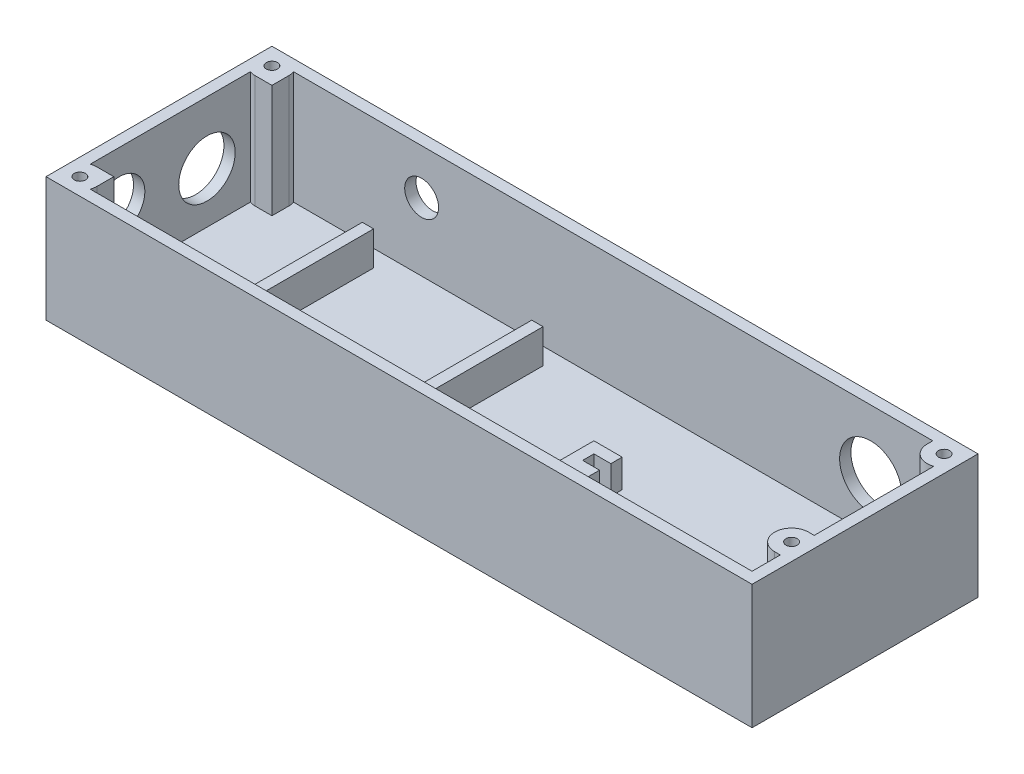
ISO-10303-21;
HEADER;
FILE_DESCRIPTION(('STEP AP214'),'2;1');
FILE_NAME('part.step','',(''),(''),'','','');
FILE_SCHEMA(('AUTOMOTIVE_DESIGN { 1 0 10303 214 1 1 1 1 }'));
ENDSEC;
DATA;
#1=APPLICATION_CONTEXT('core data for automotive mechanical design processes');
#2=APPLICATION_PROTOCOL_DEFINITION('international standard','automotive_design',2000,#1);
#3=PRODUCT_CONTEXT('',#1,'mechanical');
#4=PRODUCT('Part','Part','',(#3));
#5=PRODUCT_RELATED_PRODUCT_CATEGORY('part','',(#4));
#6=PRODUCT_DEFINITION_FORMATION('','',#4);
#7=PRODUCT_DEFINITION_CONTEXT('part definition',#1,'design');
#8=PRODUCT_DEFINITION('design','',#6,#7);
#9=PRODUCT_DEFINITION_SHAPE('','',#8);
#10=(LENGTH_UNIT() NAMED_UNIT(*) SI_UNIT(.MILLI.,.METRE.));
#11=(NAMED_UNIT(*) PLANE_ANGLE_UNIT() SI_UNIT($,.RADIAN.));
#12=(NAMED_UNIT(*) SI_UNIT($,.STERADIAN.) SOLID_ANGLE_UNIT());
#13=UNCERTAINTY_MEASURE_WITH_UNIT(LENGTH_MEASURE(1.E-05),#10,'distance_accuracy_value','');
#14=(GEOMETRIC_REPRESENTATION_CONTEXT(3) GLOBAL_UNCERTAINTY_ASSIGNED_CONTEXT((#13)) GLOBAL_UNIT_ASSIGNED_CONTEXT((#10,
#11,#12)) REPRESENTATION_CONTEXT('',''));
#15=CARTESIAN_POINT('',(0.,0.,0.));
#16=DIRECTION('',(0.,0.,1.));
#17=DIRECTION('',(1.,0.,0.));
#18=AXIS2_PLACEMENT_3D('',#15,#16,#17);
#19=CARTESIAN_POINT('',(0.,0.,0.));
#20=DIRECTION('',(0.,1.,0.));
#21=DIRECTION('',(0.,0.,1.));
#22=AXIS2_PLACEMENT_3D('',#19,#20,#21);
#23=PLANE('',#22);
#24=DIRECTION('',(1.,0.,0.));
#25=VECTOR('',#24,1.);
#26=CARTESIAN_POINT('',(0.,0.,-2.));
#27=LINE('',#26,#25);
#28=CARTESIAN_POINT('',(23.,0.,-2.));
#29=VERTEX_POINT('',#28);
#30=CARTESIAN_POINT('',(51.,0.,-2.));
#31=VERTEX_POINT('',#30);
#32=EDGE_CURVE('E517',#29,#31,#27,.T.);
#33=ORIENTED_EDGE('',*,*,#32,.T.);
#34=DIRECTION('',(0.,0.,1.));
#35=VECTOR('',#34,1.);
#36=CARTESIAN_POINT('',(51.,0.,0.));
#37=LINE('',#36,#35);
#38=CARTESIAN_POINT('',(51.,0.,-35.));
#39=VERTEX_POINT('',#38);
#40=EDGE_CURVE('E789',#39,#31,#37,.T.);
#41=ORIENTED_EDGE('',*,*,#40,.F.);
#42=DIRECTION('',(1.,0.,0.));
#43=VECTOR('',#42,1.);
#44=CARTESIAN_POINT('',(0.,0.,-35.));
#45=LINE('',#44,#43);
#46=CARTESIAN_POINT('',(53.,0.,-35.));
#47=VERTEX_POINT('',#46);
#48=EDGE_CURVE('E793',#39,#47,#45,.T.);
#49=ORIENTED_EDGE('',*,*,#48,.T.);
#50=DIRECTION('',(0.,0.,1.));
#51=VECTOR('',#50,1.);
#52=CARTESIAN_POINT('',(53.,0.,0.));
#53=LINE('',#52,#51);
#54=CARTESIAN_POINT('',(53.,0.,-2.));
#55=VERTEX_POINT('',#54);
#56=EDGE_CURVE('E805',#47,#55,#53,.T.);
#57=ORIENTED_EDGE('',*,*,#56,.T.);
#58=CARTESIAN_POINT('',(123.,0.,-2.));
#59=VERTEX_POINT('',#58);
#60=EDGE_CURVE('E512',#55,#59,#27,.T.);
#61=ORIENTED_EDGE('',*,*,#60,.T.);
#62=DIRECTION('',(0.,0.,1.));
#63=VECTOR('',#62,1.);
#64=CARTESIAN_POINT('',(123.,0.,0.));
#65=LINE('',#64,#63);
#66=CARTESIAN_POINT('',(123.,0.,-7.00000000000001));
#67=VERTEX_POINT('',#66);
#68=EDGE_CURVE('E509',#67,#59,#65,.T.);
#69=ORIENTED_EDGE('',*,*,#68,.F.);
#70=DIRECTION('',(1.,0.,0.));
#71=VECTOR('',#70,1.);
#72=CARTESIAN_POINT('',(0.,0.,-7.00000000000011));
#73=LINE('',#72,#71);
#74=CARTESIAN_POINT('',(122.,0.,-7.00000000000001));
#75=VERTEX_POINT('',#74);
#76=EDGE_CURVE('E507',#75,#67,#73,.T.);
#77=ORIENTED_EDGE('',*,*,#76,.F.);
#78=CARTESIAN_POINT('',(122.,0.,-10.));
#79=DIRECTION('',(0.,1.,0.));
#80=DIRECTION('',(0.,0.,1.));
#81=AXIS2_PLACEMENT_3D('',#78,#79,#80);
#82=CIRCLE('',#81,2.99999999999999);
#83=CARTESIAN_POINT('',(122.,0.,-13.));
#84=VERTEX_POINT('',#83);
#85=EDGE_CURVE('E505',#84,#75,#82,.T.);
#86=ORIENTED_EDGE('',*,*,#85,.F.);
#87=DIRECTION('',(1.,0.,0.));
#88=VECTOR('',#87,1.);
#89=CARTESIAN_POINT('',(0.,0.,-12.9999999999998));
#90=LINE('',#89,#88);
#91=CARTESIAN_POINT('',(123.,0.,-13.));
#92=VERTEX_POINT('',#91);
#93=EDGE_CURVE('E502',#84,#92,#90,.T.);
#94=ORIENTED_EDGE('',*,*,#93,.T.);
#95=DIRECTION('',(0.,0.,1.));
#96=VECTOR('',#95,1.);
#97=CARTESIAN_POINT('',(123.,0.,0.));
#98=LINE('',#97,#96);
#99=CARTESIAN_POINT('',(123.,0.,-34.1715728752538));
#100=VERTEX_POINT('',#99);
#101=EDGE_CURVE('E499',#100,#92,#98,.T.);
#102=ORIENTED_EDGE('',*,*,#101,.F.);
#103=CARTESIAN_POINT('',(122.,0.,-37.));
#104=DIRECTION('',(0.,1.,0.));
#105=DIRECTION('',(0.,0.,1.));
#106=AXIS2_PLACEMENT_3D('',#103,#104,#105);
#107=CIRCLE('',#106,3.);
#108=CARTESIAN_POINT('',(119.,0.,-37.));
#109=VERTEX_POINT('',#108);
#110=EDGE_CURVE('E497',#109,#100,#107,.T.);
#111=ORIENTED_EDGE('',*,*,#110,.F.);
#112=DIRECTION('',(0.,0.,-1.));
#113=VECTOR('',#112,1.);
#114=CARTESIAN_POINT('',(119.,0.,0.));
#115=LINE('',#114,#113);
#116=CARTESIAN_POINT('',(119.,0.,-38.));
#117=VERTEX_POINT('',#116);
#118=EDGE_CURVE('E494',#109,#117,#115,.T.);
#119=ORIENTED_EDGE('',*,*,#118,.T.);
#120=DIRECTION('',(1.,0.,0.));
#121=VECTOR('',#120,1.);
#122=CARTESIAN_POINT('',(0.,0.,-38.));
#123=LINE('',#122,#121);
#124=CARTESIAN_POINT('',(5.82842712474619,0.,-38.));
#125=VERTEX_POINT('',#124);
#126=EDGE_CURVE('E491',#125,#117,#123,.T.);
#127=ORIENTED_EDGE('',*,*,#126,.F.);
#128=CARTESIAN_POINT('',(3.,0.,-37.));
#129=DIRECTION('',(0.,1.,0.));
#130=DIRECTION('',(0.,0.,1.));
#131=AXIS2_PLACEMENT_3D('',#128,#129,#130);
#132=CIRCLE('',#131,3.);
#133=CARTESIAN_POINT('',(6.,0.,-37.));
#134=VERTEX_POINT('',#133);
#135=EDGE_CURVE('E489',#134,#125,#132,.T.);
#136=ORIENTED_EDGE('',*,*,#135,.F.);
#137=DIRECTION('',(0.,0.,-1.));
#138=VECTOR('',#137,1.);
#139=CARTESIAN_POINT('',(5.99999999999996,0.,0.));
#140=LINE('',#139,#138);
#141=CARTESIAN_POINT('',(6.,0.,-34.));
#142=VERTEX_POINT('',#141);
#143=EDGE_CURVE('E487',#142,#134,#140,.T.);
#144=ORIENTED_EDGE('',*,*,#143,.F.);
#145=DIRECTION('',(1.,0.,0.));
#146=VECTOR('',#145,1.);
#147=CARTESIAN_POINT('',(0.,0.,-34.));
#148=LINE('',#147,#146);
#149=CARTESIAN_POINT('',(3.,0.,-34.));
#150=VERTEX_POINT('',#149);
#151=EDGE_CURVE('E485',#150,#142,#148,.T.);
#152=ORIENTED_EDGE('',*,*,#151,.F.);
#153=CARTESIAN_POINT('',(3.,0.,-37.));
#154=DIRECTION('',(0.,1.,0.));
#155=DIRECTION('',(0.,0.,1.));
#156=AXIS2_PLACEMENT_3D('',#153,#154,#155);
#157=CIRCLE('',#156,3.);
#158=CARTESIAN_POINT('',(2.,0.,-34.1715728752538));
#159=VERTEX_POINT('',#158);
#160=EDGE_CURVE('E483',#159,#150,#157,.T.);
#161=ORIENTED_EDGE('',*,*,#160,.F.);
#162=DIRECTION('',(0.,0.,1.));
#163=VECTOR('',#162,1.);
#164=CARTESIAN_POINT('',(2.,0.,0.));
#165=LINE('',#164,#163);
#166=CARTESIAN_POINT('',(2.,0.,-5.82842712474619));
#167=VERTEX_POINT('',#166);
#168=EDGE_CURVE('E480',#159,#167,#165,.T.);
#169=ORIENTED_EDGE('',*,*,#168,.T.);
#170=CARTESIAN_POINT('',(3.,0.,-3.));
#171=DIRECTION('',(0.,1.,0.));
#172=DIRECTION('',(0.,0.,1.));
#173=AXIS2_PLACEMENT_3D('',#170,#171,#172);
#174=CIRCLE('',#173,3.);
#175=CARTESIAN_POINT('',(3.,0.,-6.));
#176=VERTEX_POINT('',#175);
#177=EDGE_CURVE('E419',#176,#167,#174,.T.);
#178=ORIENTED_EDGE('',*,*,#177,.F.);
#179=DIRECTION('',(1.,0.,0.));
#180=VECTOR('',#179,1.);
#181=CARTESIAN_POINT('',(0.,0.,-6.));
#182=LINE('',#181,#180);
#183=CARTESIAN_POINT('',(6.,0.,-6.));
#184=VERTEX_POINT('',#183);
#185=EDGE_CURVE('E413',#176,#184,#182,.T.);
#186=ORIENTED_EDGE('',*,*,#185,.T.);
#187=DIRECTION('',(0.,0.,1.));
#188=VECTOR('',#187,1.);
#189=CARTESIAN_POINT('',(6.,0.,0.));
#190=LINE('',#189,#188);
#191=CARTESIAN_POINT('',(6.,0.,-3.));
#192=VERTEX_POINT('',#191);
#193=EDGE_CURVE('E520',#184,#192,#190,.T.);
#194=ORIENTED_EDGE('',*,*,#193,.T.);
#195=CARTESIAN_POINT('',(3.,0.,-3.));
#196=DIRECTION('',(0.,1.,0.));
#197=DIRECTION('',(0.,0.,1.));
#198=AXIS2_PLACEMENT_3D('',#195,#196,#197);
#199=CIRCLE('',#198,3.);
#200=CARTESIAN_POINT('',(5.82842712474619,0.,-2.));
#201=VERTEX_POINT('',#200);
#202=EDGE_CURVE('E516',#201,#192,#199,.T.);
#203=ORIENTED_EDGE('',*,*,#202,.F.);
#204=CARTESIAN_POINT('',(21.,0.,-2.));
#205=VERTEX_POINT('',#204);
#206=EDGE_CURVE('E513',#201,#205,#27,.T.);
#207=ORIENTED_EDGE('',*,*,#206,.T.);
#208=DIRECTION('',(0.,0.,1.));
#209=VECTOR('',#208,1.);
#210=CARTESIAN_POINT('',(21.,0.,0.));
#211=LINE('',#210,#209);
#212=CARTESIAN_POINT('',(21.,0.,-35.));
#213=VERTEX_POINT('',#212);
#214=EDGE_CURVE('E818',#213,#205,#211,.T.);
#215=ORIENTED_EDGE('',*,*,#214,.F.);
#216=DIRECTION('',(1.,0.,0.));
#217=VECTOR('',#216,1.);
#218=CARTESIAN_POINT('',(0.,0.,-35.));
#219=LINE('',#218,#217);
#220=CARTESIAN_POINT('',(23.,0.,-35.));
#221=VERTEX_POINT('',#220);
#222=EDGE_CURVE('E829',#213,#221,#219,.T.);
#223=ORIENTED_EDGE('',*,*,#222,.T.);
#224=DIRECTION('',(0.,0.,1.));
#225=VECTOR('',#224,1.);
#226=CARTESIAN_POINT('',(23.,0.,0.));
#227=LINE('',#226,#225);
#228=EDGE_CURVE('E814',#221,#29,#227,.T.);
#229=ORIENTED_EDGE('',*,*,#228,.T.);
#230=EDGE_LOOP('',(#33,#41,#49,#57,#61,#69,#77,#86,#94,#102,#111,#119,#127,#136,#144,#152,#161,
#169,#178,#186,#194,#203,#207,#215,#223,#229));
#231=FACE_BOUND('',#230,.T.);
#232=DIRECTION('',(1.,0.,0.));
#233=VECTOR('',#232,1.);
#234=CARTESIAN_POINT('',(0.,0.,-20.9999999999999));
#235=LINE('',#234,#233);
#236=CARTESIAN_POINT('',(76.,0.,-21.));
#237=VERTEX_POINT('',#236);
#238=CARTESIAN_POINT('',(79.,0.,-21.));
#239=VERTEX_POINT('',#238);
#240=EDGE_CURVE('E710',#237,#239,#235,.T.);
#241=ORIENTED_EDGE('',*,*,#240,.F.);
#242=DIRECTION('',(0.,0.,-1.));
#243=VECTOR('',#242,1.);
#244=CARTESIAN_POINT('',(75.9999999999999,0.,5.27355936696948E-13));
#245=LINE('',#244,#243);
#246=CARTESIAN_POINT('',(76.,0.,-19.));
#247=VERTEX_POINT('',#246);
#248=EDGE_CURVE('E688',#247,#237,#245,.T.);
#249=ORIENTED_EDGE('',*,*,#248,.F.);
#250=DIRECTION('',(-1.,0.,0.));
#251=VECTOR('',#250,1.);
#252=CARTESIAN_POINT('',(0.,0.,-19.));
#253=LINE('',#252,#251);
#254=CARTESIAN_POINT('',(79.0000000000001,0.,-19.));
#255=VERTEX_POINT('',#254);
#256=EDGE_CURVE('E693',#255,#247,#253,.T.);
#257=ORIENTED_EDGE('',*,*,#256,.F.);
#258=DIRECTION('',(0.,0.,-1.));
#259=VECTOR('',#258,1.);
#260=CARTESIAN_POINT('',(78.9999999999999,0.,5.48172618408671E-13));
#261=LINE('',#260,#259);
#262=CARTESIAN_POINT('',(79.,0.,-17.));
#263=VERTEX_POINT('',#262);
#264=EDGE_CURVE('E720',#263,#255,#261,.T.);
#265=ORIENTED_EDGE('',*,*,#264,.F.);
#266=DIRECTION('',(1.,0.,0.));
#267=VECTOR('',#266,1.);
#268=CARTESIAN_POINT('',(0.,0.,-16.9999999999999));
#269=LINE('',#268,#267);
#270=CARTESIAN_POINT('',(74.,0.,-17.));
#271=VERTEX_POINT('',#270);
#272=EDGE_CURVE('E718',#271,#263,#269,.T.);
#273=ORIENTED_EDGE('',*,*,#272,.F.);
#274=DIRECTION('',(0.,0.,1.));
#275=VECTOR('',#274,1.);
#276=CARTESIAN_POINT('',(74.0000000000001,0.,-3.4231876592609E-13));
#277=LINE('',#276,#275);
#278=CARTESIAN_POINT('',(74.,0.,-23.));
#279=VERTEX_POINT('',#278);
#280=EDGE_CURVE('E716',#279,#271,#277,.T.);
#281=ORIENTED_EDGE('',*,*,#280,.F.);
#282=DIRECTION('',(-1.,0.,0.));
#283=VECTOR('',#282,1.);
#284=CARTESIAN_POINT('',(0.,0.,-23.));
#285=LINE('',#284,#283);
#286=CARTESIAN_POINT('',(79.,0.,-23.));
#287=VERTEX_POINT('',#286);
#288=EDGE_CURVE('E714',#287,#279,#285,.T.);
#289=ORIENTED_EDGE('',*,*,#288,.F.);
#290=DIRECTION('',(0.,0.,-1.));
#291=VECTOR('',#290,1.);
#292=CARTESIAN_POINT('',(79.0000000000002,0.,-5.48172618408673E-13));
#293=LINE('',#292,#291);
#294=EDGE_CURVE('E712',#239,#287,#293,.T.);
#295=ORIENTED_EDGE('',*,*,#294,.F.);
#296=EDGE_LOOP('',(#241,#249,#257,#265,#273,#281,#289,#295));
#297=FACE_BOUND('',#296,.T.);
#298=DIRECTION('',(0.,0.,1.));
#299=VECTOR('',#298,1.);
#300=CARTESIAN_POINT('',(120.,0.,-8.32667268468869E-13));
#301=LINE('',#300,#299);
#302=CARTESIAN_POINT('',(120.,0.,-23.));
#303=VERTEX_POINT('',#302);
#304=CARTESIAN_POINT('',(120.,0.,-17.));
#305=VERTEX_POINT('',#304);
#306=EDGE_CURVE('E624',#303,#305,#301,.T.);
#307=ORIENTED_EDGE('',*,*,#306,.T.);
#308=DIRECTION('',(-1.,0.,0.));
#309=VECTOR('',#308,1.);
#310=CARTESIAN_POINT('',(0.,0.,-16.9999999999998));
#311=LINE('',#310,#309);
#312=CARTESIAN_POINT('',(115.,0.,-17.));
#313=VERTEX_POINT('',#312);
#314=EDGE_CURVE('E629',#305,#313,#311,.T.);
#315=ORIENTED_EDGE('',*,*,#314,.T.);
#316=DIRECTION('',(0.,0.,-1.));
#317=VECTOR('',#316,1.);
#318=CARTESIAN_POINT('',(115.,0.,1.59594559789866E-12));
#319=LINE('',#318,#317);
#320=CARTESIAN_POINT('',(115.,0.,-19.));
#321=VERTEX_POINT('',#320);
#322=EDGE_CURVE('E662',#313,#321,#319,.T.);
#323=ORIENTED_EDGE('',*,*,#322,.T.);
#324=DIRECTION('',(1.,0.,0.));
#325=VECTOR('',#324,1.);
#326=CARTESIAN_POINT('',(0.,0.,-18.9999999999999));
#327=LINE('',#326,#325);
#328=CARTESIAN_POINT('',(118.,0.,-19.));
#329=VERTEX_POINT('',#328);
#330=EDGE_CURVE('E660',#321,#329,#327,.T.);
#331=ORIENTED_EDGE('',*,*,#330,.T.);
#332=DIRECTION('',(0.,0.,-1.));
#333=VECTOR('',#332,1.);
#334=CARTESIAN_POINT('',(118.,0.,-8.18789480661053E-13));
#335=LINE('',#334,#333);
#336=CARTESIAN_POINT('',(118.,0.,-21.));
#337=VERTEX_POINT('',#336);
#338=EDGE_CURVE('E658',#329,#337,#335,.T.);
#339=ORIENTED_EDGE('',*,*,#338,.T.);
#340=DIRECTION('',(-1.,0.,0.));
#341=VECTOR('',#340,1.);
#342=CARTESIAN_POINT('',(0.,0.,-21.));
#343=LINE('',#342,#341);
#344=CARTESIAN_POINT('',(115.,0.,-21.));
#345=VERTEX_POINT('',#344);
#346=EDGE_CURVE('E656',#337,#345,#343,.T.);
#347=ORIENTED_EDGE('',*,*,#346,.T.);
#348=DIRECTION('',(0.,0.,-1.));
#349=VECTOR('',#348,1.);
#350=CARTESIAN_POINT('',(115.,0.,-7.97972798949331E-13));
#351=LINE('',#350,#349);
#352=CARTESIAN_POINT('',(115.,0.,-23.));
#353=VERTEX_POINT('',#352);
#354=EDGE_CURVE('E654',#345,#353,#351,.T.);
#355=ORIENTED_EDGE('',*,*,#354,.T.);
#356=DIRECTION('',(1.,0.,0.));
#357=VECTOR('',#356,1.);
#358=CARTESIAN_POINT('',(0.,0.,-23.));
#359=LINE('',#358,#357);
#360=EDGE_CURVE('E652',#353,#303,#359,.T.);
#361=ORIENTED_EDGE('',*,*,#360,.T.);
#362=EDGE_LOOP('',(#307,#315,#323,#331,#339,#347,#355,#361));
#363=FACE_BOUND('',#362,.T.);
#364=DIRECTION('',(0.,0.,-1.));
#365=VECTOR('',#364,1.);
#366=CARTESIAN_POINT('',(110.5,0.,0.));
#367=LINE('',#366,#365);
#368=CARTESIAN_POINT('',(110.5,0.,-30.8));
#369=VERTEX_POINT('',#368);
#370=CARTESIAN_POINT('',(110.5,0.,-36.));
#371=VERTEX_POINT('',#370);
#372=EDGE_CURVE('E54',#369,#371,#367,.T.);
#373=ORIENTED_EDGE('',*,*,#372,.T.);
#374=DIRECTION('',(1.,0.,0.));
#375=VECTOR('',#374,1.);
#376=CARTESIAN_POINT('',(0.,0.,-36.));
#377=LINE('',#376,#375);
#378=CARTESIAN_POINT('',(115.5,0.,-36.));
#379=VERTEX_POINT('',#378);
#380=EDGE_CURVE('E572',#371,#379,#377,.T.);
#381=ORIENTED_EDGE('',*,*,#380,.T.);
#382=DIRECTION('',(0.,0.,1.));
#383=VECTOR('',#382,1.);
#384=CARTESIAN_POINT('',(115.5,0.,0.));
#385=LINE('',#384,#383);
#386=CARTESIAN_POINT('',(115.5,0.,-30.8));
#387=VERTEX_POINT('',#386);
#388=EDGE_CURVE('E577',#379,#387,#385,.T.);
#389=ORIENTED_EDGE('',*,*,#388,.T.);
#390=DIRECTION('',(-1.,0.,0.));
#391=VECTOR('',#390,1.);
#392=CARTESIAN_POINT('',(0.,0.,-30.8));
#393=LINE('',#392,#391);
#394=EDGE_CURVE('E59',#387,#369,#393,.T.);
#395=ORIENTED_EDGE('',*,*,#394,.T.);
#396=EDGE_LOOP('',(#373,#381,#389,#395));
#397=FACE_BOUND('',#396,.T.);
#398=ADVANCED_FACE('F37',(#231,#297,#363,#397),#23,.T.);
#399=CARTESIAN_POINT('',(23.,6.,0.));
#400=DIRECTION('',(1.,0.,0.));
#401=DIRECTION('',(0.,0.,-1.));
#402=AXIS2_PLACEMENT_3D('',#399,#400,#401);
#403=PLANE('',#402);
#404=ORIENTED_EDGE('',*,*,#228,.F.);
#405=DIRECTION('',(0.,-1.,0.));
#406=VECTOR('',#405,1.);
#407=CARTESIAN_POINT('',(23.,6.,-35.));
#408=LINE('',#407,#406);
#409=CARTESIAN_POINT('',(23.,6.,-35.));
#410=VERTEX_POINT('',#409);
#411=EDGE_CURVE('E835',#410,#221,#408,.T.);
#412=ORIENTED_EDGE('',*,*,#411,.F.);
#413=DIRECTION('',(0.,0.,1.));
#414=VECTOR('',#413,1.);
#415=CARTESIAN_POINT('',(23.,6.,0.));
#416=LINE('',#415,#414);
#417=CARTESIAN_POINT('',(23.,6.,-4.));
#418=VERTEX_POINT('',#417);
#419=EDGE_CURVE('E815',#410,#418,#416,.T.);
#420=ORIENTED_EDGE('',*,*,#419,.T.);
#421=DIRECTION('',(0.,-1.,0.));
#422=VECTOR('',#421,1.);
#423=CARTESIAN_POINT('',(23.,10.,-4.));
#424=LINE('',#423,#422);
#425=CARTESIAN_POINT('',(23.,10.,-4.));
#426=VERTEX_POINT('',#425);
#427=EDGE_CURVE('E786',#426,#418,#424,.T.);
#428=ORIENTED_EDGE('',*,*,#427,.F.);
#429=DIRECTION('',(0.,0.,1.));
#430=VECTOR('',#429,1.);
#431=CARTESIAN_POINT('',(23.,10.,0.));
#432=LINE('',#431,#430);
#433=CARTESIAN_POINT('',(23.,10.,-2.));
#434=VERTEX_POINT('',#433);
#435=EDGE_CURVE('E767',#426,#434,#432,.T.);
#436=ORIENTED_EDGE('',*,*,#435,.T.);
#437=DIRECTION('',(0.,-1.,0.));
#438=VECTOR('',#437,1.);
#439=CARTESIAN_POINT('',(23.,10.,-2.));
#440=LINE('',#439,#438);
#441=EDGE_CURVE('E778',#434,#29,#440,.T.);
#442=ORIENTED_EDGE('',*,*,#441,.T.);
#443=EDGE_LOOP('',(#404,#412,#420,#428,#436,#442));
#444=FACE_BOUND('',#443,.T.);
#445=ADVANCED_FACE('F877',(#444),#403,.T.);
#446=CARTESIAN_POINT('',(0.,6.,-35.));
#447=DIRECTION('',(0.,0.,-1.));
#448=DIRECTION('',(-1.,0.,0.));
#449=AXIS2_PLACEMENT_3D('',#446,#447,#448);
#450=PLANE('',#449);
#451=ORIENTED_EDGE('',*,*,#222,.F.);
#452=DIRECTION('',(0.,-1.,0.));
#453=VECTOR('',#452,1.);
#454=CARTESIAN_POINT('',(21.,6.,-35.));
#455=LINE('',#454,#453);
#456=CARTESIAN_POINT('',(21.,6.,-35.));
#457=VERTEX_POINT('',#456);
#458=EDGE_CURVE('E826',#457,#213,#455,.T.);
#459=ORIENTED_EDGE('',*,*,#458,.F.);
#460=DIRECTION('',(1.,0.,0.));
#461=VECTOR('',#460,1.);
#462=CARTESIAN_POINT('',(0.,6.,-35.));
#463=LINE('',#462,#461);
#464=EDGE_CURVE('E817',#457,#410,#463,.T.);
#465=ORIENTED_EDGE('',*,*,#464,.T.);
#466=ORIENTED_EDGE('',*,*,#411,.T.);
#467=EDGE_LOOP('',(#451,#459,#465,#466));
#468=FACE_BOUND('',#467,.T.);
#469=ADVANCED_FACE('F883',(#468),#450,.T.);
#470=CARTESIAN_POINT('',(21.,6.,0.));
#471=DIRECTION('',(1.,0.,0.));
#472=DIRECTION('',(0.,0.,-1.));
#473=AXIS2_PLACEMENT_3D('',#470,#471,#472);
#474=PLANE('',#473);
#475=ORIENTED_EDGE('',*,*,#214,.T.);
#476=DIRECTION('',(0.,-1.,0.));
#477=VECTOR('',#476,1.);
#478=CARTESIAN_POINT('',(21.,10.,-2.));
#479=LINE('',#478,#477);
#480=CARTESIAN_POINT('',(21.,10.,-2.));
#481=VERTEX_POINT('',#480);
#482=EDGE_CURVE('E781',#481,#205,#479,.T.);
#483=ORIENTED_EDGE('',*,*,#482,.F.);
#484=DIRECTION('',(0.,0.,1.));
#485=VECTOR('',#484,1.);
#486=CARTESIAN_POINT('',(21.,10.,0.));
#487=LINE('',#486,#485);
#488=CARTESIAN_POINT('',(21.,10.,-4.));
#489=VERTEX_POINT('',#488);
#490=EDGE_CURVE('E772',#489,#481,#487,.T.);
#491=ORIENTED_EDGE('',*,*,#490,.F.);
#492=DIRECTION('',(0.,-1.,0.));
#493=VECTOR('',#492,1.);
#494=CARTESIAN_POINT('',(21.,10.,-4.));
#495=LINE('',#494,#493);
#496=CARTESIAN_POINT('',(21.,6.,-4.));
#497=VERTEX_POINT('',#496);
#498=EDGE_CURVE('E783',#489,#497,#495,.T.);
#499=ORIENTED_EDGE('',*,*,#498,.T.);
#500=DIRECTION('',(0.,0.,1.));
#501=VECTOR('',#500,1.);
#502=CARTESIAN_POINT('',(21.,6.,0.));
#503=LINE('',#502,#501);
#504=EDGE_CURVE('E821',#457,#497,#503,.T.);
#505=ORIENTED_EDGE('',*,*,#504,.F.);
#506=ORIENTED_EDGE('',*,*,#458,.T.);
#507=EDGE_LOOP('',(#475,#483,#491,#499,#505,#506));
#508=FACE_BOUND('',#507,.T.);
#509=ADVANCED_FACE('F893',(#508),#474,.F.);
#510=CARTESIAN_POINT('',(0.,6.,0.));
#511=DIRECTION('',(0.,1.,0.));
#512=DIRECTION('',(0.,0.,1.));
#513=AXIS2_PLACEMENT_3D('',#510,#511,#512);
#514=PLANE('',#513);
#515=ORIENTED_EDGE('',*,*,#419,.F.);
#516=ORIENTED_EDGE('',*,*,#464,.F.);
#517=ORIENTED_EDGE('',*,*,#504,.T.);
#518=DIRECTION('',(-1.,0.,0.));
#519=VECTOR('',#518,1.);
#520=CARTESIAN_POINT('',(0.,6.,-4.));
#521=LINE('',#520,#519);
#522=EDGE_CURVE('E823',#418,#497,#521,.T.);
#523=ORIENTED_EDGE('',*,*,#522,.F.);
#524=EDGE_LOOP('',(#515,#516,#517,#523));
#525=FACE_BOUND('',#524,.T.);
#526=ADVANCED_FACE('F897',(#525),#514,.T.);
#527=CARTESIAN_POINT('',(51.,6.,0.));
#528=DIRECTION('',(1.,0.,0.));
#529=DIRECTION('',(0.,0.,-1.));
#530=AXIS2_PLACEMENT_3D('',#527,#528,#529);
#531=PLANE('',#530);
#532=ORIENTED_EDGE('',*,*,#40,.T.);
#533=DIRECTION('',(0.,-1.,0.));
#534=VECTOR('',#533,1.);
#535=CARTESIAN_POINT('',(51.,10.,-2.));
#536=LINE('',#535,#534);
#537=CARTESIAN_POINT('',(51.,10.,-2.));
#538=VERTEX_POINT('',#537);
#539=EDGE_CURVE('E759',#538,#31,#536,.T.);
#540=ORIENTED_EDGE('',*,*,#539,.F.);
#541=DIRECTION('',(0.,0.,1.));
#542=VECTOR('',#541,1.);
#543=CARTESIAN_POINT('',(51.,10.,0.));
#544=LINE('',#543,#542);
#545=CARTESIAN_POINT('',(51.,10.,-4.));
#546=VERTEX_POINT('',#545);
#547=EDGE_CURVE('E750',#546,#538,#544,.T.);
#548=ORIENTED_EDGE('',*,*,#547,.F.);
#549=DIRECTION('',(0.,-1.,0.));
#550=VECTOR('',#549,1.);
#551=CARTESIAN_POINT('',(51.,10.,-4.));
#552=LINE('',#551,#550);
#553=CARTESIAN_POINT('',(51.,6.,-4.));
#554=VERTEX_POINT('',#553);
#555=EDGE_CURVE('E761',#546,#554,#552,.T.);
#556=ORIENTED_EDGE('',*,*,#555,.T.);
#557=DIRECTION('',(0.,0.,1.));
#558=VECTOR('',#557,1.);
#559=CARTESIAN_POINT('',(51.,6.,0.));
#560=LINE('',#559,#558);
#561=CARTESIAN_POINT('',(51.,6.,-35.));
#562=VERTEX_POINT('',#561);
#563=EDGE_CURVE('E790',#562,#554,#560,.T.);
#564=ORIENTED_EDGE('',*,*,#563,.F.);
#565=DIRECTION('',(0.,-1.,0.));
#566=VECTOR('',#565,1.);
#567=CARTESIAN_POINT('',(51.,6.,-35.));
#568=LINE('',#567,#566);
#569=EDGE_CURVE('E802',#562,#39,#568,.T.);
#570=ORIENTED_EDGE('',*,*,#569,.T.);
#571=EDGE_LOOP('',(#532,#540,#548,#556,#564,#570));
#572=FACE_BOUND('',#571,.T.);
#573=ADVANCED_FACE('F901',(#572),#531,.F.);
#574=CARTESIAN_POINT('',(53.,6.,0.));
#575=DIRECTION('',(1.,0.,0.));
#576=DIRECTION('',(0.,0.,-1.));
#577=AXIS2_PLACEMENT_3D('',#574,#575,#576);
#578=PLANE('',#577);
#579=ORIENTED_EDGE('',*,*,#56,.F.);
#580=DIRECTION('',(0.,-1.,0.));
#581=VECTOR('',#580,1.);
#582=CARTESIAN_POINT('',(53.,6.,-35.));
#583=LINE('',#582,#581);
#584=CARTESIAN_POINT('',(53.,6.,-35.));
#585=VERTEX_POINT('',#584);
#586=EDGE_CURVE('E811',#585,#47,#583,.T.);
#587=ORIENTED_EDGE('',*,*,#586,.F.);
#588=DIRECTION('',(0.,0.,1.));
#589=VECTOR('',#588,1.);
#590=CARTESIAN_POINT('',(53.,6.,0.));
#591=LINE('',#590,#589);
#592=CARTESIAN_POINT('',(53.,6.,-4.));
#593=VERTEX_POINT('',#592);
#594=EDGE_CURVE('E796',#585,#593,#591,.T.);
#595=ORIENTED_EDGE('',*,*,#594,.T.);
#596=DIRECTION('',(0.,-1.,0.));
#597=VECTOR('',#596,1.);
#598=CARTESIAN_POINT('',(53.,10.,-4.));
#599=LINE('',#598,#597);
#600=CARTESIAN_POINT('',(53.,10.,-4.));
#601=VERTEX_POINT('',#600);
#602=EDGE_CURVE('E764',#601,#593,#599,.T.);
#603=ORIENTED_EDGE('',*,*,#602,.F.);
#604=DIRECTION('',(0.,0.,1.));
#605=VECTOR('',#604,1.);
#606=CARTESIAN_POINT('',(53.,10.,0.));
#607=LINE('',#606,#605);
#608=CARTESIAN_POINT('',(53.,10.,-2.));
#609=VERTEX_POINT('',#608);
#610=EDGE_CURVE('E745',#601,#609,#607,.T.);
#611=ORIENTED_EDGE('',*,*,#610,.T.);
#612=DIRECTION('',(0.,-1.,0.));
#613=VECTOR('',#612,1.);
#614=CARTESIAN_POINT('',(53.,10.,-2.));
#615=LINE('',#614,#613);
#616=EDGE_CURVE('E756',#609,#55,#615,.T.);
#617=ORIENTED_EDGE('',*,*,#616,.T.);
#618=EDGE_LOOP('',(#579,#587,#595,#603,#611,#617));
#619=FACE_BOUND('',#618,.T.);
#620=ADVANCED_FACE('F905',(#619),#578,.T.);
#621=CARTESIAN_POINT('',(0.,6.,-35.));
#622=DIRECTION('',(0.,0.,-1.));
#623=DIRECTION('',(-1.,0.,0.));
#624=AXIS2_PLACEMENT_3D('',#621,#622,#623);
#625=PLANE('',#624);
#626=ORIENTED_EDGE('',*,*,#48,.F.);
#627=ORIENTED_EDGE('',*,*,#569,.F.);
#628=DIRECTION('',(1.,0.,0.));
#629=VECTOR('',#628,1.);
#630=CARTESIAN_POINT('',(0.,6.,-35.));
#631=LINE('',#630,#629);
#632=EDGE_CURVE('E799',#562,#585,#631,.T.);
#633=ORIENTED_EDGE('',*,*,#632,.T.);
#634=ORIENTED_EDGE('',*,*,#586,.T.);
#635=EDGE_LOOP('',(#626,#627,#633,#634));
#636=FACE_BOUND('',#635,.T.);
#637=ADVANCED_FACE('F909',(#636),#625,.T.);
#638=CARTESIAN_POINT('',(0.,6.,0.));
#639=DIRECTION('',(0.,1.,0.));
#640=DIRECTION('',(0.,0.,1.));
#641=AXIS2_PLACEMENT_3D('',#638,#639,#640);
#642=PLANE('',#641);
#643=ORIENTED_EDGE('',*,*,#563,.T.);
#644=DIRECTION('',(-1.,0.,0.));
#645=VECTOR('',#644,1.);
#646=CARTESIAN_POINT('',(0.,6.,-4.));
#647=LINE('',#646,#645);
#648=EDGE_CURVE('E792',#593,#554,#647,.T.);
#649=ORIENTED_EDGE('',*,*,#648,.F.);
#650=ORIENTED_EDGE('',*,*,#594,.F.);
#651=ORIENTED_EDGE('',*,*,#632,.F.);
#652=EDGE_LOOP('',(#643,#649,#650,#651));
#653=FACE_BOUND('',#652,.T.);
#654=ADVANCED_FACE('F913',(#653),#642,.T.);
#655=CARTESIAN_POINT('',(0.,10.,-4.));
#656=DIRECTION('',(0.,0.,1.));
#657=DIRECTION('',(1.,0.,0.));
#658=AXIS2_PLACEMENT_3D('',#655,#656,#657);
#659=PLANE('',#658);
#660=ORIENTED_EDGE('',*,*,#522,.T.);
#661=ORIENTED_EDGE('',*,*,#498,.F.);
#662=DIRECTION('',(-1.,0.,0.));
#663=VECTOR('',#662,1.);
#664=CARTESIAN_POINT('',(0.,10.,-4.));
#665=LINE('',#664,#663);
#666=EDGE_CURVE('E770',#426,#489,#665,.T.);
#667=ORIENTED_EDGE('',*,*,#666,.F.);
#668=ORIENTED_EDGE('',*,*,#427,.T.);
#669=EDGE_LOOP('',(#660,#661,#667,#668));
#670=FACE_BOUND('',#669,.T.);
#671=ADVANCED_FACE('F917',(#670),#659,.F.);
#672=CARTESIAN_POINT('',(0.,10.,0.));
#673=DIRECTION('',(0.,1.,0.));
#674=DIRECTION('',(0.,0.,1.));
#675=AXIS2_PLACEMENT_3D('',#672,#673,#674);
#676=PLANE('',#675);
#677=ORIENTED_EDGE('',*,*,#435,.F.);
#678=ORIENTED_EDGE('',*,*,#666,.T.);
#679=ORIENTED_EDGE('',*,*,#490,.T.);
#680=DIRECTION('',(1.,0.,0.));
#681=VECTOR('',#680,1.);
#682=CARTESIAN_POINT('',(0.,10.,-2.));
#683=LINE('',#682,#681);
#684=EDGE_CURVE('E775',#481,#434,#683,.T.);
#685=ORIENTED_EDGE('',*,*,#684,.T.);
#686=EDGE_LOOP('',(#677,#678,#679,#685));
#687=FACE_BOUND('',#686,.T.);
#688=ADVANCED_FACE('F921',(#687),#676,.T.);
#689=CARTESIAN_POINT('',(0.,10.,-4.));
#690=DIRECTION('',(0.,0.,1.));
#691=DIRECTION('',(1.,0.,0.));
#692=AXIS2_PLACEMENT_3D('',#689,#690,#691);
#693=PLANE('',#692);
#694=ORIENTED_EDGE('',*,*,#648,.T.);
#695=ORIENTED_EDGE('',*,*,#555,.F.);
#696=DIRECTION('',(-1.,0.,0.));
#697=VECTOR('',#696,1.);
#698=CARTESIAN_POINT('',(0.,10.,-4.));
#699=LINE('',#698,#697);
#700=EDGE_CURVE('E748',#601,#546,#699,.T.);
#701=ORIENTED_EDGE('',*,*,#700,.F.);
#702=ORIENTED_EDGE('',*,*,#602,.T.);
#703=EDGE_LOOP('',(#694,#695,#701,#702));
#704=FACE_BOUND('',#703,.T.);
#705=ADVANCED_FACE('F925',(#704),#693,.F.);
#706=CARTESIAN_POINT('',(0.,10.,0.));
#707=DIRECTION('',(0.,1.,0.));
#708=DIRECTION('',(0.,0.,1.));
#709=AXIS2_PLACEMENT_3D('',#706,#707,#708);
#710=PLANE('',#709);
#711=ORIENTED_EDGE('',*,*,#610,.F.);
#712=ORIENTED_EDGE('',*,*,#700,.T.);
#713=ORIENTED_EDGE('',*,*,#547,.T.);
#714=DIRECTION('',(1.,0.,0.));
#715=VECTOR('',#714,1.);
#716=CARTESIAN_POINT('',(0.,10.,-2.));
#717=LINE('',#716,#715);
#718=EDGE_CURVE('E753',#538,#609,#717,.T.);
#719=ORIENTED_EDGE('',*,*,#718,.T.);
#720=EDGE_LOOP('',(#711,#712,#713,#719));
#721=FACE_BOUND('',#720,.T.);
#722=ADVANCED_FACE('F929',(#721),#710,.T.);
#723=CARTESIAN_POINT('',(75.9999999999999,5.,5.27355936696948E-13));
#724=DIRECTION('',(-1.,0.,0.));
#725=DIRECTION('',(0.,0.,1.));
#726=AXIS2_PLACEMENT_3D('',#723,#724,#725);
#727=PLANE('',#726);
#728=ORIENTED_EDGE('',*,*,#248,.T.);
#729=DIRECTION('',(0.,-1.,0.));
#730=VECTOR('',#729,1.);
#731=CARTESIAN_POINT('',(76.,5.,-21.));
#732=LINE('',#731,#730);
#733=CARTESIAN_POINT('',(76.,5.,-21.));
#734=VERTEX_POINT('',#733);
#735=EDGE_CURVE('E743',#734,#237,#732,.T.);
#736=ORIENTED_EDGE('',*,*,#735,.F.);
#737=DIRECTION('',(0.,0.,-1.));
#738=VECTOR('',#737,1.);
#739=CARTESIAN_POINT('',(75.9999999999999,5.,5.27355936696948E-13));
#740=LINE('',#739,#738);
#741=CARTESIAN_POINT('',(76.,5.,-19.));
#742=VERTEX_POINT('',#741);
#743=EDGE_CURVE('E689',#742,#734,#740,.T.);
#744=ORIENTED_EDGE('',*,*,#743,.F.);
#745=DIRECTION('',(0.,-1.,0.));
#746=VECTOR('',#745,1.);
#747=CARTESIAN_POINT('',(76.,5.,-19.));
#748=LINE('',#747,#746);
#749=EDGE_CURVE('E707',#742,#247,#748,.T.);
#750=ORIENTED_EDGE('',*,*,#749,.T.);
#751=EDGE_LOOP('',(#728,#736,#744,#750));
#752=FACE_BOUND('',#751,.T.);
#753=ADVANCED_FACE('F933',(#752),#727,.F.);
#754=CARTESIAN_POINT('',(0.,5.,-20.9999999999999));
#755=DIRECTION('',(0.,0.,-1.));
#756=DIRECTION('',(-1.,0.,0.));
#757=AXIS2_PLACEMENT_3D('',#754,#755,#756);
#758=PLANE('',#757);
#759=ORIENTED_EDGE('',*,*,#240,.T.);
#760=DIRECTION('',(0.,-1.,0.));
#761=VECTOR('',#760,1.);
#762=CARTESIAN_POINT('',(79.,5.,-21.));
#763=LINE('',#762,#761);
#764=CARTESIAN_POINT('',(79.,5.,-21.));
#765=VERTEX_POINT('',#764);
#766=EDGE_CURVE('E740',#765,#239,#763,.T.);
#767=ORIENTED_EDGE('',*,*,#766,.F.);
#768=DIRECTION('',(1.,0.,0.));
#769=VECTOR('',#768,1.);
#770=CARTESIAN_POINT('',(0.,5.,-20.9999999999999));
#771=LINE('',#770,#769);
#772=EDGE_CURVE('E692',#734,#765,#771,.T.);
#773=ORIENTED_EDGE('',*,*,#772,.F.);
#774=ORIENTED_EDGE('',*,*,#735,.T.);
#775=EDGE_LOOP('',(#759,#767,#773,#774));
#776=FACE_BOUND('',#775,.T.);
#777=ADVANCED_FACE('F937',(#776),#758,.F.);
#778=CARTESIAN_POINT('',(79.0000000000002,5.,-5.48172618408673E-13));
#779=DIRECTION('',(-1.,0.,0.));
#780=DIRECTION('',(0.,0.,1.));
#781=AXIS2_PLACEMENT_3D('',#778,#779,#780);
#782=PLANE('',#781);
#783=ORIENTED_EDGE('',*,*,#294,.T.);
#784=DIRECTION('',(0.,-1.,0.));
#785=VECTOR('',#784,1.);
#786=CARTESIAN_POINT('',(79.,5.,-23.));
#787=LINE('',#786,#785);
#788=CARTESIAN_POINT('',(79.,5.,-23.));
#789=VERTEX_POINT('',#788);
#790=EDGE_CURVE('E737',#789,#287,#787,.T.);
#791=ORIENTED_EDGE('',*,*,#790,.F.);
#792=DIRECTION('',(0.,0.,-1.));
#793=VECTOR('',#792,1.);
#794=CARTESIAN_POINT('',(79.0000000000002,5.,-5.48172618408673E-13));
#795=LINE('',#794,#793);
#796=EDGE_CURVE('E695',#765,#789,#795,.T.);
#797=ORIENTED_EDGE('',*,*,#796,.F.);
#798=ORIENTED_EDGE('',*,*,#766,.T.);
#799=EDGE_LOOP('',(#783,#791,#797,#798));
#800=FACE_BOUND('',#799,.T.);
#801=ADVANCED_FACE('F941',(#800),#782,.F.);
#802=CARTESIAN_POINT('',(0.,5.,-23.));
#803=DIRECTION('',(0.,0.,1.));
#804=DIRECTION('',(1.,0.,0.));
#805=AXIS2_PLACEMENT_3D('',#802,#803,#804);
#806=PLANE('',#805);
#807=ORIENTED_EDGE('',*,*,#288,.T.);
#808=DIRECTION('',(0.,-1.,0.));
#809=VECTOR('',#808,1.);
#810=CARTESIAN_POINT('',(74.,5.,-23.));
#811=LINE('',#810,#809);
#812=CARTESIAN_POINT('',(74.,5.,-23.));
#813=VERTEX_POINT('',#812);
#814=EDGE_CURVE('E734',#813,#279,#811,.T.);
#815=ORIENTED_EDGE('',*,*,#814,.F.);
#816=DIRECTION('',(-1.,0.,0.));
#817=VECTOR('',#816,1.);
#818=CARTESIAN_POINT('',(0.,5.,-23.));
#819=LINE('',#818,#817);
#820=EDGE_CURVE('E697',#789,#813,#819,.T.);
#821=ORIENTED_EDGE('',*,*,#820,.F.);
#822=ORIENTED_EDGE('',*,*,#790,.T.);
#823=EDGE_LOOP('',(#807,#815,#821,#822));
#824=FACE_BOUND('',#823,.T.);
#825=ADVANCED_FACE('F945',(#824),#806,.F.);
#826=CARTESIAN_POINT('',(74.0000000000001,5.,-3.4231876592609E-13));
#827=DIRECTION('',(1.,0.,0.));
#828=DIRECTION('',(0.,0.,-1.));
#829=AXIS2_PLACEMENT_3D('',#826,#827,#828);
#830=PLANE('',#829);
#831=ORIENTED_EDGE('',*,*,#280,.T.);
#832=DIRECTION('',(0.,-1.,0.));
#833=VECTOR('',#832,1.);
#834=CARTESIAN_POINT('',(74.,5.,-17.));
#835=LINE('',#834,#833);
#836=CARTESIAN_POINT('',(74.,5.,-17.));
#837=VERTEX_POINT('',#836);
#838=EDGE_CURVE('E731',#837,#271,#835,.T.);
#839=ORIENTED_EDGE('',*,*,#838,.F.);
#840=DIRECTION('',(0.,0.,1.));
#841=VECTOR('',#840,1.);
#842=CARTESIAN_POINT('',(74.0000000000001,5.,-3.4231876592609E-13));
#843=LINE('',#842,#841);
#844=EDGE_CURVE('E699',#813,#837,#843,.T.);
#845=ORIENTED_EDGE('',*,*,#844,.F.);
#846=ORIENTED_EDGE('',*,*,#814,.T.);
#847=EDGE_LOOP('',(#831,#839,#845,#846));
#848=FACE_BOUND('',#847,.T.);
#849=ADVANCED_FACE('F949',(#848),#830,.F.);
#850=CARTESIAN_POINT('',(0.,5.,-16.9999999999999));
#851=DIRECTION('',(0.,0.,-1.));
#852=DIRECTION('',(-1.,0.,0.));
#853=AXIS2_PLACEMENT_3D('',#850,#851,#852);
#854=PLANE('',#853);
#855=ORIENTED_EDGE('',*,*,#272,.T.);
#856=DIRECTION('',(0.,-1.,0.));
#857=VECTOR('',#856,1.);
#858=CARTESIAN_POINT('',(79.,5.,-17.));
#859=LINE('',#858,#857);
#860=CARTESIAN_POINT('',(79.,5.,-17.));
#861=VERTEX_POINT('',#860);
#862=EDGE_CURVE('E728',#861,#263,#859,.T.);
#863=ORIENTED_EDGE('',*,*,#862,.F.);
#864=DIRECTION('',(1.,0.,0.));
#865=VECTOR('',#864,1.);
#866=CARTESIAN_POINT('',(0.,5.,-16.9999999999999));
#867=LINE('',#866,#865);
#868=EDGE_CURVE('E701',#837,#861,#867,.T.);
#869=ORIENTED_EDGE('',*,*,#868,.F.);
#870=ORIENTED_EDGE('',*,*,#838,.T.);
#871=EDGE_LOOP('',(#855,#863,#869,#870));
#872=FACE_BOUND('',#871,.T.);
#873=ADVANCED_FACE('F953',(#872),#854,.F.);
#874=CARTESIAN_POINT('',(78.9999999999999,5.,5.48172618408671E-13));
#875=DIRECTION('',(-1.,0.,0.));
#876=DIRECTION('',(0.,0.,1.));
#877=AXIS2_PLACEMENT_3D('',#874,#875,#876);
#878=PLANE('',#877);
#879=ORIENTED_EDGE('',*,*,#264,.T.);
#880=DIRECTION('',(0.,-1.,0.));
#881=VECTOR('',#880,1.);
#882=CARTESIAN_POINT('',(79.0000000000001,5.,-19.));
#883=LINE('',#882,#881);
#884=CARTESIAN_POINT('',(79.0000000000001,5.,-19.));
#885=VERTEX_POINT('',#884);
#886=EDGE_CURVE('E726',#885,#255,#883,.T.);
#887=ORIENTED_EDGE('',*,*,#886,.F.);
#888=DIRECTION('',(0.,0.,-1.));
#889=VECTOR('',#888,1.);
#890=CARTESIAN_POINT('',(78.9999999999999,5.,5.48172618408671E-13));
#891=LINE('',#890,#889);
#892=EDGE_CURVE('E703',#861,#885,#891,.T.);
#893=ORIENTED_EDGE('',*,*,#892,.F.);
#894=ORIENTED_EDGE('',*,*,#862,.T.);
#895=EDGE_LOOP('',(#879,#887,#893,#894));
#896=FACE_BOUND('',#895,.T.);
#897=ADVANCED_FACE('F957',(#896),#878,.F.);
#898=CARTESIAN_POINT('',(0.,5.,-19.));
#899=DIRECTION('',(0.,0.,1.));
#900=DIRECTION('',(1.,0.,0.));
#901=AXIS2_PLACEMENT_3D('',#898,#899,#900);
#902=PLANE('',#901);
#903=ORIENTED_EDGE('',*,*,#256,.T.);
#904=ORIENTED_EDGE('',*,*,#749,.F.);
#905=DIRECTION('',(-1.,0.,0.));
#906=VECTOR('',#905,1.);
#907=CARTESIAN_POINT('',(0.,5.,-19.));
#908=LINE('',#907,#906);
#909=EDGE_CURVE('E705',#885,#742,#908,.T.);
#910=ORIENTED_EDGE('',*,*,#909,.F.);
#911=ORIENTED_EDGE('',*,*,#886,.T.);
#912=EDGE_LOOP('',(#903,#904,#910,#911));
#913=FACE_BOUND('',#912,.T.);
#914=ADVANCED_FACE('F961',(#913),#902,.F.);
#915=CARTESIAN_POINT('',(0.,5.,0.));
#916=DIRECTION('',(0.,1.,0.));
#917=DIRECTION('',(0.,0.,1.));
#918=AXIS2_PLACEMENT_3D('',#915,#916,#917);
#919=PLANE('',#918);
#920=ORIENTED_EDGE('',*,*,#743,.T.);
#921=ORIENTED_EDGE('',*,*,#772,.T.);
#922=ORIENTED_EDGE('',*,*,#796,.T.);
#923=ORIENTED_EDGE('',*,*,#820,.T.);
#924=ORIENTED_EDGE('',*,*,#844,.T.);
#925=ORIENTED_EDGE('',*,*,#868,.T.);
#926=ORIENTED_EDGE('',*,*,#892,.T.);
#927=ORIENTED_EDGE('',*,*,#909,.T.);
#928=EDGE_LOOP('',(#920,#921,#922,#923,#924,#925,#926,#927));
#929=FACE_BOUND('',#928,.T.);
#930=ADVANCED_FACE('F965',(#929),#919,.T.);
#931=CARTESIAN_POINT('',(120.,5.,-8.32667268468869E-13));
#932=DIRECTION('',(1.,0.,0.));
#933=DIRECTION('',(0.,0.,-1.));
#934=AXIS2_PLACEMENT_3D('',#931,#932,#933);
#935=PLANE('',#934);
#936=ORIENTED_EDGE('',*,*,#306,.F.);
#937=DIRECTION('',(0.,-1.,0.));
#938=VECTOR('',#937,1.);
#939=CARTESIAN_POINT('',(120.,5.,-23.));
#940=LINE('',#939,#938);
#941=CARTESIAN_POINT('',(120.,5.,-23.));
#942=VERTEX_POINT('',#941);
#943=EDGE_CURVE('E685',#942,#303,#940,.T.);
#944=ORIENTED_EDGE('',*,*,#943,.F.);
#945=DIRECTION('',(0.,0.,1.));
#946=VECTOR('',#945,1.);
#947=CARTESIAN_POINT('',(120.,5.,-8.32667268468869E-13));
#948=LINE('',#947,#946);
#949=CARTESIAN_POINT('',(120.,5.,-17.));
#950=VERTEX_POINT('',#949);
#951=EDGE_CURVE('E625',#942,#950,#948,.T.);
#952=ORIENTED_EDGE('',*,*,#951,.T.);
#953=DIRECTION('',(0.,-1.,0.));
#954=VECTOR('',#953,1.);
#955=CARTESIAN_POINT('',(120.,5.,-17.));
#956=LINE('',#955,#954);
#957=EDGE_CURVE('E650',#950,#305,#956,.T.);
#958=ORIENTED_EDGE('',*,*,#957,.T.);
#959=EDGE_LOOP('',(#936,#944,#952,#958));
#960=FACE_BOUND('',#959,.T.);
#961=ADVANCED_FACE('F969',(#960),#935,.T.);
#962=CARTESIAN_POINT('',(0.,5.,-23.));
#963=DIRECTION('',(0.,0.,-1.));
#964=DIRECTION('',(-1.,0.,0.));
#965=AXIS2_PLACEMENT_3D('',#962,#963,#964);
#966=PLANE('',#965);
#967=ORIENTED_EDGE('',*,*,#360,.F.);
#968=DIRECTION('',(0.,-1.,0.));
#969=VECTOR('',#968,1.);
#970=CARTESIAN_POINT('',(115.,5.,-23.));
#971=LINE('',#970,#969);
#972=CARTESIAN_POINT('',(115.,5.,-23.));
#973=VERTEX_POINT('',#972);
#974=EDGE_CURVE('E682',#973,#353,#971,.T.);
#975=ORIENTED_EDGE('',*,*,#974,.F.);
#976=DIRECTION('',(1.,0.,0.));
#977=VECTOR('',#976,1.);
#978=CARTESIAN_POINT('',(0.,5.,-23.));
#979=LINE('',#978,#977);
#980=EDGE_CURVE('E628',#973,#942,#979,.T.);
#981=ORIENTED_EDGE('',*,*,#980,.T.);
#982=ORIENTED_EDGE('',*,*,#943,.T.);
#983=EDGE_LOOP('',(#967,#975,#981,#982));
#984=FACE_BOUND('',#983,.T.);
#985=ADVANCED_FACE('F973',(#984),#966,.T.);
#986=CARTESIAN_POINT('',(115.,5.,-7.97972798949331E-13));
#987=DIRECTION('',(-1.,0.,0.));
#988=DIRECTION('',(0.,0.,1.));
#989=AXIS2_PLACEMENT_3D('',#986,#987,#988);
#990=PLANE('',#989);
#991=ORIENTED_EDGE('',*,*,#354,.F.);
#992=DIRECTION('',(0.,-1.,0.));
#993=VECTOR('',#992,1.);
#994=CARTESIAN_POINT('',(115.,5.,-21.));
#995=LINE('',#994,#993);
#996=CARTESIAN_POINT('',(115.,5.,-21.));
#997=VERTEX_POINT('',#996);
#998=EDGE_CURVE('E679',#997,#345,#995,.T.);
#999=ORIENTED_EDGE('',*,*,#998,.F.);
#1000=DIRECTION('',(0.,0.,-1.));
#1001=VECTOR('',#1000,1.);
#1002=CARTESIAN_POINT('',(115.,5.,-7.97972798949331E-13));
#1003=LINE('',#1002,#1001);
#1004=EDGE_CURVE('E632',#997,#973,#1003,.T.);
#1005=ORIENTED_EDGE('',*,*,#1004,.T.);
#1006=ORIENTED_EDGE('',*,*,#974,.T.);
#1007=EDGE_LOOP('',(#991,#999,#1005,#1006));
#1008=FACE_BOUND('',#1007,.T.);
#1009=ADVANCED_FACE('F977',(#1008),#990,.T.);
#1010=CARTESIAN_POINT('',(0.,5.,-21.));
#1011=DIRECTION('',(0.,0.,1.));
#1012=DIRECTION('',(1.,0.,0.));
#1013=AXIS2_PLACEMENT_3D('',#1010,#1011,#1012);
#1014=PLANE('',#1013);
#1015=ORIENTED_EDGE('',*,*,#346,.F.);
#1016=DIRECTION('',(0.,-1.,0.));
#1017=VECTOR('',#1016,1.);
#1018=CARTESIAN_POINT('',(118.,5.,-21.));
#1019=LINE('',#1018,#1017);
#1020=CARTESIAN_POINT('',(118.,5.,-21.));
#1021=VERTEX_POINT('',#1020);
#1022=EDGE_CURVE('E676',#1021,#337,#1019,.T.);
#1023=ORIENTED_EDGE('',*,*,#1022,.F.);
#1024=DIRECTION('',(-1.,0.,0.));
#1025=VECTOR('',#1024,1.);
#1026=CARTESIAN_POINT('',(0.,5.,-21.));
#1027=LINE('',#1026,#1025);
#1028=EDGE_CURVE('E635',#1021,#997,#1027,.T.);
#1029=ORIENTED_EDGE('',*,*,#1028,.T.);
#1030=ORIENTED_EDGE('',*,*,#998,.T.);
#1031=EDGE_LOOP('',(#1015,#1023,#1029,#1030));
#1032=FACE_BOUND('',#1031,.T.);
#1033=ADVANCED_FACE('F981',(#1032),#1014,.T.);
#1034=CARTESIAN_POINT('',(118.,5.,-8.18789480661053E-13));
#1035=DIRECTION('',(-1.,0.,0.));
#1036=DIRECTION('',(0.,0.,1.));
#1037=AXIS2_PLACEMENT_3D('',#1034,#1035,#1036);
#1038=PLANE('',#1037);
#1039=ORIENTED_EDGE('',*,*,#338,.F.);
#1040=DIRECTION('',(0.,-1.,0.));
#1041=VECTOR('',#1040,1.);
#1042=CARTESIAN_POINT('',(118.,5.,-19.));
#1043=LINE('',#1042,#1041);
#1044=CARTESIAN_POINT('',(118.,5.,-19.));
#1045=VERTEX_POINT('',#1044);
#1046=EDGE_CURVE('E673',#1045,#329,#1043,.T.);
#1047=ORIENTED_EDGE('',*,*,#1046,.F.);
#1048=DIRECTION('',(0.,0.,-1.));
#1049=VECTOR('',#1048,1.);
#1050=CARTESIAN_POINT('',(118.,5.,-8.18789480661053E-13));
#1051=LINE('',#1050,#1049);
#1052=EDGE_CURVE('E638',#1045,#1021,#1051,.T.);
#1053=ORIENTED_EDGE('',*,*,#1052,.T.);
#1054=ORIENTED_EDGE('',*,*,#1022,.T.);
#1055=EDGE_LOOP('',(#1039,#1047,#1053,#1054));
#1056=FACE_BOUND('',#1055,.T.);
#1057=ADVANCED_FACE('F985',(#1056),#1038,.T.);
#1058=CARTESIAN_POINT('',(0.,5.,-18.9999999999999));
#1059=DIRECTION('',(0.,0.,-1.));
#1060=DIRECTION('',(-1.,0.,0.));
#1061=AXIS2_PLACEMENT_3D('',#1058,#1059,#1060);
#1062=PLANE('',#1061);
#1063=ORIENTED_EDGE('',*,*,#330,.F.);
#1064=DIRECTION('',(0.,-1.,0.));
#1065=VECTOR('',#1064,1.);
#1066=CARTESIAN_POINT('',(115.,5.,-19.));
#1067=LINE('',#1066,#1065);
#1068=CARTESIAN_POINT('',(115.,5.,-19.));
#1069=VERTEX_POINT('',#1068);
#1070=EDGE_CURVE('E670',#1069,#321,#1067,.T.);
#1071=ORIENTED_EDGE('',*,*,#1070,.F.);
#1072=DIRECTION('',(1.,0.,0.));
#1073=VECTOR('',#1072,1.);
#1074=CARTESIAN_POINT('',(0.,5.,-18.9999999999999));
#1075=LINE('',#1074,#1073);
#1076=EDGE_CURVE('E641',#1069,#1045,#1075,.T.);
#1077=ORIENTED_EDGE('',*,*,#1076,.T.);
#1078=ORIENTED_EDGE('',*,*,#1046,.T.);
#1079=EDGE_LOOP('',(#1063,#1071,#1077,#1078));
#1080=FACE_BOUND('',#1079,.T.);
#1081=ADVANCED_FACE('F989',(#1080),#1062,.T.);
#1082=CARTESIAN_POINT('',(115.,5.,1.59594559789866E-12));
#1083=DIRECTION('',(-1.,0.,0.));
#1084=DIRECTION('',(0.,0.,1.));
#1085=AXIS2_PLACEMENT_3D('',#1082,#1083,#1084);
#1086=PLANE('',#1085);
#1087=ORIENTED_EDGE('',*,*,#322,.F.);
#1088=DIRECTION('',(0.,-1.,0.));
#1089=VECTOR('',#1088,1.);
#1090=CARTESIAN_POINT('',(115.,5.,-17.));
#1091=LINE('',#1090,#1089);
#1092=CARTESIAN_POINT('',(115.,5.,-17.));
#1093=VERTEX_POINT('',#1092);
#1094=EDGE_CURVE('E667',#1093,#313,#1091,.T.);
#1095=ORIENTED_EDGE('',*,*,#1094,.F.);
#1096=DIRECTION('',(0.,0.,-1.));
#1097=VECTOR('',#1096,1.);
#1098=CARTESIAN_POINT('',(115.,5.,1.59594559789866E-12));
#1099=LINE('',#1098,#1097);
#1100=EDGE_CURVE('E644',#1093,#1069,#1099,.T.);
#1101=ORIENTED_EDGE('',*,*,#1100,.T.);
#1102=ORIENTED_EDGE('',*,*,#1070,.T.);
#1103=EDGE_LOOP('',(#1087,#1095,#1101,#1102));
#1104=FACE_BOUND('',#1103,.T.);
#1105=ADVANCED_FACE('F993',(#1104),#1086,.T.);
#1106=CARTESIAN_POINT('',(0.,5.,-16.9999999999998));
#1107=DIRECTION('',(0.,0.,1.));
#1108=DIRECTION('',(1.,0.,0.));
#1109=AXIS2_PLACEMENT_3D('',#1106,#1107,#1108);
#1110=PLANE('',#1109);
#1111=ORIENTED_EDGE('',*,*,#314,.F.);
#1112=ORIENTED_EDGE('',*,*,#957,.F.);
#1113=DIRECTION('',(-1.,0.,0.));
#1114=VECTOR('',#1113,1.);
#1115=CARTESIAN_POINT('',(0.,5.,-16.9999999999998));
#1116=LINE('',#1115,#1114);
#1117=EDGE_CURVE('E647',#950,#1093,#1116,.T.);
#1118=ORIENTED_EDGE('',*,*,#1117,.T.);
#1119=ORIENTED_EDGE('',*,*,#1094,.T.);
#1120=EDGE_LOOP('',(#1111,#1112,#1118,#1119));
#1121=FACE_BOUND('',#1120,.T.);
#1122=ADVANCED_FACE('F997',(#1121),#1110,.T.);
#1123=CARTESIAN_POINT('',(0.,5.,0.));
#1124=DIRECTION('',(0.,1.,0.));
#1125=DIRECTION('',(0.,0.,1.));
#1126=AXIS2_PLACEMENT_3D('',#1123,#1124,#1125);
#1127=PLANE('',#1126);
#1128=ORIENTED_EDGE('',*,*,#951,.F.);
#1129=ORIENTED_EDGE('',*,*,#980,.F.);
#1130=ORIENTED_EDGE('',*,*,#1004,.F.);
#1131=ORIENTED_EDGE('',*,*,#1028,.F.);
#1132=ORIENTED_EDGE('',*,*,#1052,.F.);
#1133=ORIENTED_EDGE('',*,*,#1076,.F.);
#1134=ORIENTED_EDGE('',*,*,#1100,.F.);
#1135=ORIENTED_EDGE('',*,*,#1117,.F.);
#1136=EDGE_LOOP('',(#1128,#1129,#1130,#1131,#1132,#1133,#1134,#1135));
#1137=FACE_BOUND('',#1136,.T.);
#1138=ADVANCED_FACE('F1001',(#1137),#1127,.T.);
#1139=CARTESIAN_POINT('',(0.,4.,-36.));
#1140=DIRECTION('',(0.,0.,-1.));
#1141=DIRECTION('',(-1.,0.,0.));
#1142=AXIS2_PLACEMENT_3D('',#1139,#1140,#1141);
#1143=PLANE('',#1142);
#1144=ORIENTED_EDGE('',*,*,#380,.F.);
#1145=DIRECTION('',(0.,-1.,0.));
#1146=VECTOR('',#1145,1.);
#1147=CARTESIAN_POINT('',(110.5,4.,-36.));
#1148=LINE('',#1147,#1146);
#1149=CARTESIAN_POINT('',(110.5,4.,-36.));
#1150=VERTEX_POINT('',#1149);
#1151=EDGE_CURVE('E622',#1150,#371,#1148,.T.);
#1152=ORIENTED_EDGE('',*,*,#1151,.F.);
#1153=DIRECTION('',(1.,0.,0.));
#1154=VECTOR('',#1153,1.);
#1155=CARTESIAN_POINT('',(0.,4.,-36.));
#1156=LINE('',#1155,#1154);
#1157=CARTESIAN_POINT('',(115.5,4.,-36.));
#1158=VERTEX_POINT('',#1157);
#1159=EDGE_CURVE('E573',#1150,#1158,#1156,.T.);
#1160=ORIENTED_EDGE('',*,*,#1159,.T.);
#1161=DIRECTION('',(0.,-1.,0.));
#1162=VECTOR('',#1161,1.);
#1163=CARTESIAN_POINT('',(115.5,4.,-36.));
#1164=LINE('',#1163,#1162);
#1165=EDGE_CURVE('E598',#1158,#379,#1164,.T.);
#1166=ORIENTED_EDGE('',*,*,#1165,.T.);
#1167=EDGE_LOOP('',(#1144,#1152,#1160,#1166));
#1168=FACE_BOUND('',#1167,.T.);
#1169=ADVANCED_FACE('F1005',(#1168),#1143,.T.);
#1170=CARTESIAN_POINT('',(110.5,4.,-7.6674777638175E-13));
#1171=DIRECTION('',(-1.,0.,0.));
#1172=DIRECTION('',(0.,0.,1.));
#1173=AXIS2_PLACEMENT_3D('',#1170,#1171,#1172);
#1174=PLANE('',#1173);
#1175=ORIENTED_EDGE('',*,*,#1151,.T.);
#1176=ORIENTED_EDGE('',*,*,#372,.F.);
#1177=DIRECTION('',(0.,-1.,0.));
#1178=VECTOR('',#1177,1.);
#1179=CARTESIAN_POINT('',(110.5,4.,-30.8));
#1180=LINE('',#1179,#1178);
#1181=CARTESIAN_POINT('',(110.5,4.,-30.8));
#1182=VERTEX_POINT('',#1181);
#1183=EDGE_CURVE('E608',#1182,#369,#1180,.T.);
#1184=ORIENTED_EDGE('',*,*,#1183,.F.);
#1185=DIRECTION('',(0.,0.,-1.));
#1186=VECTOR('',#1185,1.);
#1187=CARTESIAN_POINT('',(110.5,4.,0.));
#1188=LINE('',#1187,#1186);
#1189=CARTESIAN_POINT('',(110.5,4.,-32.8));
#1190=VERTEX_POINT('',#1189);
#1191=EDGE_CURVE('E589',#1182,#1190,#1188,.T.);
#1192=ORIENTED_EDGE('',*,*,#1191,.T.);
#1193=DIRECTION('',(0.,-1.,0.));
#1194=VECTOR('',#1193,1.);
#1195=CARTESIAN_POINT('',(110.5,4.,-32.8));
#1196=LINE('',#1195,#1194);
#1197=CARTESIAN_POINT('',(110.5,2.,-32.8));
#1198=VERTEX_POINT('',#1197);
#1199=EDGE_CURVE('E610',#1190,#1198,#1196,.T.);
#1200=ORIENTED_EDGE('',*,*,#1199,.T.);
#1201=DIRECTION('',(0.,0.,1.));
#1202=VECTOR('',#1201,1.);
#1203=CARTESIAN_POINT('',(110.5,2.,0.));
#1204=LINE('',#1203,#1202);
#1205=CARTESIAN_POINT('',(110.5,2.,-34.));
#1206=VERTEX_POINT('',#1205);
#1207=EDGE_CURVE('E566',#1206,#1198,#1204,.T.);
#1208=ORIENTED_EDGE('',*,*,#1207,.F.);
#1209=DIRECTION('',(0.,-1.,0.));
#1210=VECTOR('',#1209,1.);
#1211=CARTESIAN_POINT('',(110.5,4.,-34.));
#1212=LINE('',#1211,#1210);
#1213=CARTESIAN_POINT('',(110.5,4.,-34.));
#1214=VERTEX_POINT('',#1213);
#1215=EDGE_CURVE('E619',#1214,#1206,#1212,.T.);
#1216=ORIENTED_EDGE('',*,*,#1215,.F.);
#1217=DIRECTION('',(0.,0.,-1.));
#1218=VECTOR('',#1217,1.);
#1219=CARTESIAN_POINT('',(110.5,4.,-7.6674777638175E-13));
#1220=LINE('',#1219,#1218);
#1221=EDGE_CURVE('E576',#1214,#1150,#1220,.T.);
#1222=ORIENTED_EDGE('',*,*,#1221,.T.);
#1223=EDGE_LOOP('',(#1175,#1176,#1184,#1192,#1200,#1208,#1216,#1222));
#1224=FACE_BOUND('',#1223,.T.);
#1225=ADVANCED_FACE('F1009',(#1224),#1174,.T.);
#1226=CARTESIAN_POINT('',(0.,4.,-34.));
#1227=DIRECTION('',(0.,0.,1.));
#1228=DIRECTION('',(1.,0.,0.));
#1229=AXIS2_PLACEMENT_3D('',#1226,#1227,#1228);
#1230=PLANE('',#1229);
#1231=DIRECTION('',(-1.,0.,0.));
#1232=VECTOR('',#1231,1.);
#1233=CARTESIAN_POINT('',(0.,2.,-34.));
#1234=LINE('',#1233,#1232);
#1235=CARTESIAN_POINT('',(113.5,2.,-34.));
#1236=VERTEX_POINT('',#1235);
#1237=EDGE_CURVE('E423',#1236,#1206,#1234,.T.);
#1238=ORIENTED_EDGE('',*,*,#1237,.F.);
#1239=DIRECTION('',(0.,-1.,0.));
#1240=VECTOR('',#1239,1.);
#1241=CARTESIAN_POINT('',(113.5,4.,-34.));
#1242=LINE('',#1241,#1240);
#1243=CARTESIAN_POINT('',(113.5,4.,-34.));
#1244=VERTEX_POINT('',#1243);
#1245=EDGE_CURVE('E616',#1244,#1236,#1242,.T.);
#1246=ORIENTED_EDGE('',*,*,#1245,.F.);
#1247=DIRECTION('',(-1.,0.,0.));
#1248=VECTOR('',#1247,1.);
#1249=CARTESIAN_POINT('',(0.,4.,-34.));
#1250=LINE('',#1249,#1248);
#1251=EDGE_CURVE('E580',#1244,#1214,#1250,.T.);
#1252=ORIENTED_EDGE('',*,*,#1251,.T.);
#1253=ORIENTED_EDGE('',*,*,#1215,.T.);
#1254=EDGE_LOOP('',(#1238,#1246,#1252,#1253));
#1255=FACE_BOUND('',#1254,.T.);
#1256=ADVANCED_FACE('F1013',(#1255),#1230,.T.);
#1257=CARTESIAN_POINT('',(113.5,4.,0.));
#1258=DIRECTION('',(-1.,0.,0.));
#1259=DIRECTION('',(0.,0.,1.));
#1260=AXIS2_PLACEMENT_3D('',#1257,#1258,#1259);
#1261=PLANE('',#1260);
#1262=DIRECTION('',(0.,0.,-1.));
#1263=VECTOR('',#1262,1.);
#1264=CARTESIAN_POINT('',(113.5,2.,0.));
#1265=LINE('',#1264,#1263);
#1266=CARTESIAN_POINT('',(113.5,2.,-32.8));
#1267=VERTEX_POINT('',#1266);
#1268=EDGE_CURVE('E570',#1267,#1236,#1265,.T.);
#1269=ORIENTED_EDGE('',*,*,#1268,.F.);
#1270=DIRECTION('',(0.,-1.,0.));
#1271=VECTOR('',#1270,1.);
#1272=CARTESIAN_POINT('',(113.5,4.,-32.8));
#1273=LINE('',#1272,#1271);
#1274=CARTESIAN_POINT('',(113.5,4.,-32.8));
#1275=VERTEX_POINT('',#1274);
#1276=EDGE_CURVE('E613',#1275,#1267,#1273,.T.);
#1277=ORIENTED_EDGE('',*,*,#1276,.F.);
#1278=DIRECTION('',(0.,0.,-1.));
#1279=VECTOR('',#1278,1.);
#1280=CARTESIAN_POINT('',(113.5,4.,0.));
#1281=LINE('',#1280,#1279);
#1282=EDGE_CURVE('E583',#1275,#1244,#1281,.T.);
#1283=ORIENTED_EDGE('',*,*,#1282,.T.);
#1284=ORIENTED_EDGE('',*,*,#1245,.T.);
#1285=EDGE_LOOP('',(#1269,#1277,#1283,#1284));
#1286=FACE_BOUND('',#1285,.T.);
#1287=ADVANCED_FACE('F1017',(#1286),#1261,.T.);
#1288=CARTESIAN_POINT('',(0.,4.,-32.8));
#1289=DIRECTION('',(0.,0.,-1.));
#1290=DIRECTION('',(-1.,0.,0.));
#1291=AXIS2_PLACEMENT_3D('',#1288,#1289,#1290);
#1292=PLANE('',#1291);
#1293=DIRECTION('',(1.,0.,0.));
#1294=VECTOR('',#1293,1.);
#1295=CARTESIAN_POINT('',(0.,2.,-32.8));
#1296=LINE('',#1295,#1294);
#1297=EDGE_CURVE('E568',#1198,#1267,#1296,.T.);
#1298=ORIENTED_EDGE('',*,*,#1297,.F.);
#1299=ORIENTED_EDGE('',*,*,#1199,.F.);
#1300=DIRECTION('',(1.,0.,0.));
#1301=VECTOR('',#1300,1.);
#1302=CARTESIAN_POINT('',(0.,4.,-32.8));
#1303=LINE('',#1302,#1301);
#1304=EDGE_CURVE('E586',#1190,#1275,#1303,.T.);
#1305=ORIENTED_EDGE('',*,*,#1304,.T.);
#1306=ORIENTED_EDGE('',*,*,#1276,.T.);
#1307=EDGE_LOOP('',(#1298,#1299,#1305,#1306));
#1308=FACE_BOUND('',#1307,.T.);
#1309=ADVANCED_FACE('F1021',(#1308),#1292,.T.);
#1310=CARTESIAN_POINT('',(0.,4.,-30.8));
#1311=DIRECTION('',(0.,0.,1.));
#1312=DIRECTION('',(1.,0.,0.));
#1313=AXIS2_PLACEMENT_3D('',#1310,#1311,#1312);
#1314=PLANE('',#1313);
#1315=ORIENTED_EDGE('',*,*,#394,.F.);
#1316=DIRECTION('',(0.,-1.,0.));
#1317=VECTOR('',#1316,1.);
#1318=CARTESIAN_POINT('',(115.5,4.,-30.8));
#1319=LINE('',#1318,#1317);
#1320=CARTESIAN_POINT('',(115.5,4.,-30.8));
#1321=VERTEX_POINT('',#1320);
#1322=EDGE_CURVE('E605',#1321,#387,#1319,.T.);
#1323=ORIENTED_EDGE('',*,*,#1322,.F.);
#1324=DIRECTION('',(-1.,0.,0.));
#1325=VECTOR('',#1324,1.);
#1326=CARTESIAN_POINT('',(0.,4.,-30.8));
#1327=LINE('',#1326,#1325);
#1328=EDGE_CURVE('E592',#1321,#1182,#1327,.T.);
#1329=ORIENTED_EDGE('',*,*,#1328,.T.);
#1330=ORIENTED_EDGE('',*,*,#1183,.T.);
#1331=EDGE_LOOP('',(#1315,#1323,#1329,#1330));
#1332=FACE_BOUND('',#1331,.T.);
#1333=ADVANCED_FACE('F1025',(#1332),#1314,.T.);
#1334=CARTESIAN_POINT('',(115.5,4.,0.));
#1335=DIRECTION('',(1.,0.,0.));
#1336=DIRECTION('',(0.,0.,-1.));
#1337=AXIS2_PLACEMENT_3D('',#1334,#1335,#1336);
#1338=PLANE('',#1337);
#1339=ORIENTED_EDGE('',*,*,#388,.F.);
#1340=ORIENTED_EDGE('',*,*,#1165,.F.);
#1341=DIRECTION('',(0.,0.,1.));
#1342=VECTOR('',#1341,1.);
#1343=CARTESIAN_POINT('',(115.5,4.,0.));
#1344=LINE('',#1343,#1342);
#1345=EDGE_CURVE('E595',#1158,#1321,#1344,.T.);
#1346=ORIENTED_EDGE('',*,*,#1345,.T.);
#1347=ORIENTED_EDGE('',*,*,#1322,.T.);
#1348=EDGE_LOOP('',(#1339,#1340,#1346,#1347));
#1349=FACE_BOUND('',#1348,.T.);
#1350=ADVANCED_FACE('F1029',(#1349),#1338,.T.);
#1351=CARTESIAN_POINT('',(0.,4.,0.));
#1352=DIRECTION('',(0.,1.,0.));
#1353=DIRECTION('',(0.,0.,1.));
#1354=AXIS2_PLACEMENT_3D('',#1351,#1352,#1353);
#1355=PLANE('',#1354);
#1356=ORIENTED_EDGE('',*,*,#1159,.F.);
#1357=ORIENTED_EDGE('',*,*,#1221,.F.);
#1358=ORIENTED_EDGE('',*,*,#1251,.F.);
#1359=ORIENTED_EDGE('',*,*,#1282,.F.);
#1360=ORIENTED_EDGE('',*,*,#1304,.F.);
#1361=ORIENTED_EDGE('',*,*,#1191,.F.);
#1362=ORIENTED_EDGE('',*,*,#1328,.F.);
#1363=ORIENTED_EDGE('',*,*,#1345,.F.);
#1364=EDGE_LOOP('',(#1356,#1357,#1358,#1359,#1360,#1361,#1362,#1363));
#1365=FACE_BOUND('',#1364,.T.);
#1366=ADVANCED_FACE('F1033',(#1365),#1355,.T.);
#1367=CARTESIAN_POINT('',(0.,2.,0.));
#1368=DIRECTION('',(0.,1.,0.));
#1369=DIRECTION('',(0.,0.,1.));
#1370=AXIS2_PLACEMENT_3D('',#1367,#1368,#1369);
#1371=PLANE('',#1370);
#1372=ORIENTED_EDGE('',*,*,#1237,.T.);
#1373=ORIENTED_EDGE('',*,*,#1207,.T.);
#1374=ORIENTED_EDGE('',*,*,#1297,.T.);
#1375=ORIENTED_EDGE('',*,*,#1268,.T.);
#1376=EDGE_LOOP('',(#1372,#1373,#1374,#1375));
#1377=FACE_BOUND('',#1376,.T.);
#1378=ADVANCED_FACE('F1037',(#1377),#1371,.T.);
#1379=CARTESIAN_POINT('',(0.,20.,-2.));
#1380=DIRECTION('',(0.,0.,-1.));
#1381=DIRECTION('',(-1.,0.,0.));
#1382=AXIS2_PLACEMENT_3D('',#1379,#1380,#1381);
#1383=PLANE('',#1382);
#1384=ORIENTED_EDGE('',*,*,#32,.F.);
#1385=ORIENTED_EDGE('',*,*,#441,.F.);
#1386=ORIENTED_EDGE('',*,*,#684,.F.);
#1387=ORIENTED_EDGE('',*,*,#482,.T.);
#1388=ORIENTED_EDGE('',*,*,#206,.F.);
#1389=DIRECTION('',(0.,-1.,0.));
#1390=VECTOR('',#1389,1.);
#1391=CARTESIAN_POINT('',(5.82842712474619,20.,-2.));
#1392=LINE('',#1391,#1390);
#1393=CARTESIAN_POINT('',(5.82842712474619,20.,-2.));
#1394=VERTEX_POINT('',#1393);
#1395=EDGE_CURVE('E530',#1394,#201,#1392,.T.);
#1396=ORIENTED_EDGE('',*,*,#1395,.F.);
#1397=DIRECTION('',(1.,0.,0.));
#1398=VECTOR('',#1397,1.);
#1399=CARTESIAN_POINT('',(0.,20.,-2.));
#1400=LINE('',#1399,#1398);
#1401=CARTESIAN_POINT('',(123.,20.,-2.));
#1402=VERTEX_POINT('',#1401);
#1403=EDGE_CURVE('E457',#1394,#1402,#1400,.T.);
#1404=ORIENTED_EDGE('',*,*,#1403,.T.);
#1405=DIRECTION('',(0.,-1.,0.));
#1406=VECTOR('',#1405,1.);
#1407=CARTESIAN_POINT('',(123.,20.,-2.));
#1408=LINE('',#1407,#1406);
#1409=EDGE_CURVE('E532',#1402,#59,#1408,.T.);
#1410=ORIENTED_EDGE('',*,*,#1409,.T.);
#1411=ORIENTED_EDGE('',*,*,#60,.F.);
#1412=ORIENTED_EDGE('',*,*,#616,.F.);
#1413=ORIENTED_EDGE('',*,*,#718,.F.);
#1414=ORIENTED_EDGE('',*,*,#539,.T.);
#1415=EDGE_LOOP('',(#1384,#1385,#1386,#1387,#1388,#1396,#1404,#1410,#1411,#1412,#1413,#1414));
#1416=FACE_BOUND('',#1415,.T.);
#1417=ADVANCED_FACE('F1041',(#1416),#1383,.T.);
#1418=CARTESIAN_POINT('',(3.,20.,-3.));
#1419=DIRECTION('',(0.,-1.,0.));
#1420=DIRECTION('',(0.,0.,-1.));
#1421=AXIS2_PLACEMENT_3D('',#1418,#1419,#1420);
#1422=CYLINDRICAL_SURFACE('',#1421,3.);
#1423=ORIENTED_EDGE('',*,*,#177,.T.);
#1424=DIRECTION('',(0.,-1.,0.));
#1425=VECTOR('',#1424,1.);
#1426=CARTESIAN_POINT('',(2.,20.,-5.82842712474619));
#1427=LINE('',#1426,#1425);
#1428=CARTESIAN_POINT('',(2.,20.,-5.82842712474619));
#1429=VERTEX_POINT('',#1428);
#1430=EDGE_CURVE('E416',#1429,#167,#1427,.T.);
#1431=ORIENTED_EDGE('',*,*,#1430,.F.);
#1432=CARTESIAN_POINT('',(3.,20.,-3.));
#1433=DIRECTION('',(0.,1.,0.));
#1434=DIRECTION('',(0.,0.,1.));
#1435=AXIS2_PLACEMENT_3D('',#1432,#1433,#1434);
#1436=CIRCLE('',#1435,3.);
#1437=CARTESIAN_POINT('',(3.,20.,-6.));
#1438=VERTEX_POINT('',#1437);
#1439=EDGE_CURVE('E403',#1438,#1429,#1436,.T.);
#1440=ORIENTED_EDGE('',*,*,#1439,.F.);
#1441=DIRECTION('',(0.,-1.,0.));
#1442=VECTOR('',#1441,1.);
#1443=CARTESIAN_POINT('',(3.,20.,-6.));
#1444=LINE('',#1443,#1442);
#1445=EDGE_CURVE('E478',#1438,#176,#1444,.T.);
#1446=ORIENTED_EDGE('',*,*,#1445,.T.);
#1447=EDGE_LOOP('',(#1423,#1431,#1440,#1446));
#1448=FACE_BOUND('',#1447,.T.);
#1449=ADVANCED_FACE('F417',(#1448),#1422,.T.);
#1450=CARTESIAN_POINT('',(2.,20.,0.));
#1451=DIRECTION('',(1.,0.,0.));
#1452=DIRECTION('',(0.,0.,-1.));
#1453=AXIS2_PLACEMENT_3D('',#1450,#1451,#1452);
#1454=PLANE('',#1453);
#1455=CARTESIAN_POINT('',(2.,9.,-26.5));
#1456=DIRECTION('',(1.,0.,0.));
#1457=DIRECTION('',(0.,0.,-1.));
#1458=AXIS2_PLACEMENT_3D('',#1455,#1456,#1457);
#1459=CIRCLE('',#1458,5.);
#1460=CARTESIAN_POINT('',(2.,9.,-31.5));
#1461=VERTEX_POINT('',#1460);
#1462=EDGE_CURVE('E1166',#1461,#1461,#1459,.F.);
#1463=ORIENTED_EDGE('',*,*,#1462,.T.);
#1464=EDGE_LOOP('',(#1463));
#1465=FACE_BOUND('',#1464,.T.);
#1466=CARTESIAN_POINT('',(2.,11.,-11.));
#1467=DIRECTION('',(1.,0.,0.));
#1468=DIRECTION('',(0.,0.,-1.));
#1469=AXIS2_PLACEMENT_3D('',#1466,#1467,#1468);
#1470=CIRCLE('',#1469,4.5);
#1471=CARTESIAN_POINT('',(2.,11.,-15.5));
#1472=VERTEX_POINT('',#1471);
#1473=EDGE_CURVE('E1171',#1472,#1472,#1470,.F.);
#1474=ORIENTED_EDGE('',*,*,#1473,.T.);
#1475=EDGE_LOOP('',(#1474));
#1476=FACE_BOUND('',#1475,.T.);
#1477=ORIENTED_EDGE('',*,*,#168,.F.);
#1478=DIRECTION('',(0.,-1.,0.));
#1479=VECTOR('',#1478,1.);
#1480=CARTESIAN_POINT('',(2.,20.,-34.1715728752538));
#1481=LINE('',#1480,#1479);
#1482=CARTESIAN_POINT('',(2.,20.,-34.1715728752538));
#1483=VERTEX_POINT('',#1482);
#1484=EDGE_CURVE('E424',#1483,#159,#1481,.T.);
#1485=ORIENTED_EDGE('',*,*,#1484,.F.);
#1486=DIRECTION('',(0.,0.,1.));
#1487=VECTOR('',#1486,1.);
#1488=CARTESIAN_POINT('',(2.,20.,0.));
#1489=LINE('',#1488,#1487);
#1490=EDGE_CURVE('E408',#1483,#1429,#1489,.T.);
#1491=ORIENTED_EDGE('',*,*,#1490,.T.);
#1492=ORIENTED_EDGE('',*,*,#1430,.T.);
#1493=EDGE_LOOP('',(#1477,#1485,#1491,#1492));
#1494=FACE_BOUND('',#1493,.T.);
#1495=ADVANCED_FACE('F426',(#1465,#1476,#1494),#1454,.T.);
#1496=CARTESIAN_POINT('',(3.,20.,-37.));
#1497=DIRECTION('',(0.,-1.,0.));
#1498=DIRECTION('',(0.,0.,-1.));
#1499=AXIS2_PLACEMENT_3D('',#1496,#1497,#1498);
#1500=CYLINDRICAL_SURFACE('',#1499,3.);
#1501=ORIENTED_EDGE('',*,*,#160,.T.);
#1502=DIRECTION('',(0.,-1.,0.));
#1503=VECTOR('',#1502,1.);
#1504=CARTESIAN_POINT('',(3.,20.,-34.));
#1505=LINE('',#1504,#1503);
#1506=CARTESIAN_POINT('',(3.,20.,-34.));
#1507=VERTEX_POINT('',#1506);
#1508=EDGE_CURVE('E560',#1507,#150,#1505,.T.);
#1509=ORIENTED_EDGE('',*,*,#1508,.F.);
#1510=CARTESIAN_POINT('',(3.,20.,-37.));
#1511=DIRECTION('',(0.,1.,0.));
#1512=DIRECTION('',(0.,0.,1.));
#1513=AXIS2_PLACEMENT_3D('',#1510,#1511,#1512);
#1514=CIRCLE('',#1513,3.);
#1515=EDGE_CURVE('E428',#1483,#1507,#1514,.T.);
#1516=ORIENTED_EDGE('',*,*,#1515,.F.);
#1517=ORIENTED_EDGE('',*,*,#1484,.T.);
#1518=EDGE_LOOP('',(#1501,#1509,#1516,#1517));
#1519=FACE_BOUND('',#1518,.T.);
#1520=ADVANCED_FACE('F1047',(#1519),#1500,.T.);
#1521=CARTESIAN_POINT('',(0.,20.,-34.));
#1522=DIRECTION('',(0.,0.,-1.));
#1523=DIRECTION('',(-1.,0.,0.));
#1524=AXIS2_PLACEMENT_3D('',#1521,#1522,#1523);
#1525=PLANE('',#1524);
#1526=ORIENTED_EDGE('',*,*,#151,.T.);
#1527=DIRECTION('',(0.,-1.,0.));
#1528=VECTOR('',#1527,1.);
#1529=CARTESIAN_POINT('',(6.,20.,-34.));
#1530=LINE('',#1529,#1528);
#1531=CARTESIAN_POINT('',(6.,20.,-34.));
#1532=VERTEX_POINT('',#1531);
#1533=EDGE_CURVE('E557',#1532,#142,#1530,.T.);
#1534=ORIENTED_EDGE('',*,*,#1533,.F.);
#1535=DIRECTION('',(1.,0.,0.));
#1536=VECTOR('',#1535,1.);
#1537=CARTESIAN_POINT('',(0.,20.,-34.));
#1538=LINE('',#1537,#1536);
#1539=EDGE_CURVE('E430',#1507,#1532,#1538,.T.);
#1540=ORIENTED_EDGE('',*,*,#1539,.F.);
#1541=ORIENTED_EDGE('',*,*,#1508,.T.);
#1542=EDGE_LOOP('',(#1526,#1534,#1540,#1541));
#1543=FACE_BOUND('',#1542,.T.);
#1544=ADVANCED_FACE('F1051',(#1543),#1525,.F.);
#1545=CARTESIAN_POINT('',(5.99999999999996,20.,0.));
#1546=DIRECTION('',(-1.,0.,0.));
#1547=DIRECTION('',(0.,0.,1.));
#1548=AXIS2_PLACEMENT_3D('',#1545,#1546,#1547);
#1549=PLANE('',#1548);
#1550=ORIENTED_EDGE('',*,*,#143,.T.);
#1551=DIRECTION('',(0.,-1.,0.));
#1552=VECTOR('',#1551,1.);
#1553=CARTESIAN_POINT('',(6.,20.,-37.));
#1554=LINE('',#1553,#1552);
#1555=CARTESIAN_POINT('',(6.,20.,-37.));
#1556=VERTEX_POINT('',#1555);
#1557=EDGE_CURVE('E554',#1556,#134,#1554,.T.);
#1558=ORIENTED_EDGE('',*,*,#1557,.F.);
#1559=DIRECTION('',(0.,0.,-1.));
#1560=VECTOR('',#1559,1.);
#1561=CARTESIAN_POINT('',(5.99999999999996,20.,0.));
#1562=LINE('',#1561,#1560);
#1563=EDGE_CURVE('E435',#1532,#1556,#1562,.T.);
#1564=ORIENTED_EDGE('',*,*,#1563,.F.);
#1565=ORIENTED_EDGE('',*,*,#1533,.T.);
#1566=EDGE_LOOP('',(#1550,#1558,#1564,#1565));
#1567=FACE_BOUND('',#1566,.T.);
#1568=ADVANCED_FACE('F1055',(#1567),#1549,.F.);
#1569=CARTESIAN_POINT('',(3.,20.,-37.));
#1570=DIRECTION('',(0.,-1.,0.));
#1571=DIRECTION('',(0.,0.,-1.));
#1572=AXIS2_PLACEMENT_3D('',#1569,#1570,#1571);
#1573=CYLINDRICAL_SURFACE('',#1572,3.);
#1574=ORIENTED_EDGE('',*,*,#135,.T.);
#1575=DIRECTION('',(0.,-1.,0.));
#1576=VECTOR('',#1575,1.);
#1577=CARTESIAN_POINT('',(5.82842712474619,20.,-38.));
#1578=LINE('',#1577,#1576);
#1579=CARTESIAN_POINT('',(5.82842712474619,20.,-38.));
#1580=VERTEX_POINT('',#1579);
#1581=EDGE_CURVE('E551',#1580,#125,#1578,.T.);
#1582=ORIENTED_EDGE('',*,*,#1581,.F.);
#1583=CARTESIAN_POINT('',(3.,20.,-37.));
#1584=DIRECTION('',(0.,1.,0.));
#1585=DIRECTION('',(0.,0.,1.));
#1586=AXIS2_PLACEMENT_3D('',#1583,#1584,#1585);
#1587=CIRCLE('',#1586,3.);
#1588=EDGE_CURVE('E437',#1556,#1580,#1587,.T.);
#1589=ORIENTED_EDGE('',*,*,#1588,.F.);
#1590=ORIENTED_EDGE('',*,*,#1557,.T.);
#1591=EDGE_LOOP('',(#1574,#1582,#1589,#1590));
#1592=FACE_BOUND('',#1591,.T.);
#1593=ADVANCED_FACE('F1059',(#1592),#1573,.T.);
#1594=CARTESIAN_POINT('',(0.,20.,-38.));
#1595=DIRECTION('',(0.,0.,-1.));
#1596=DIRECTION('',(-1.,0.,0.));
#1597=AXIS2_PLACEMENT_3D('',#1594,#1595,#1596);
#1598=PLANE('',#1597);
#1599=CARTESIAN_POINT('',(28.5,12.,-38.));
#1600=DIRECTION('',(0.,0.,-1.));
#1601=DIRECTION('',(-1.,0.,0.));
#1602=AXIS2_PLACEMENT_3D('',#1599,#1600,#1601);
#1603=CIRCLE('',#1602,3.);
#1604=CARTESIAN_POINT('',(25.5,12.,-38.));
#1605=VERTEX_POINT('',#1604);
#1606=EDGE_CURVE('E1181',#1605,#1605,#1603,.F.);
#1607=ORIENTED_EDGE('',*,*,#1606,.F.);
#1608=EDGE_LOOP('',(#1607));
#1609=FACE_BOUND('',#1608,.T.);
#1610=CARTESIAN_POINT('',(108.,9.,-38.));
#1611=DIRECTION('',(0.,0.,-1.));
#1612=DIRECTION('',(-1.,0.,0.));
#1613=AXIS2_PLACEMENT_3D('',#1610,#1611,#1612);
#1614=CIRCLE('',#1613,5.5);
#1615=CARTESIAN_POINT('',(102.5,9.,-38.));
#1616=VERTEX_POINT('',#1615);
#1617=EDGE_CURVE('E1187',#1616,#1616,#1614,.F.);
#1618=ORIENTED_EDGE('',*,*,#1617,.F.);
#1619=EDGE_LOOP('',(#1618));
#1620=FACE_BOUND('',#1619,.T.);
#1621=ORIENTED_EDGE('',*,*,#126,.T.);
#1622=DIRECTION('',(0.,-1.,0.));
#1623=VECTOR('',#1622,1.);
#1624=CARTESIAN_POINT('',(119.,20.,-38.));
#1625=LINE('',#1624,#1623);
#1626=CARTESIAN_POINT('',(119.,20.,-38.));
#1627=VERTEX_POINT('',#1626);
#1628=EDGE_CURVE('E549',#1627,#117,#1625,.T.);
#1629=ORIENTED_EDGE('',*,*,#1628,.F.);
#1630=DIRECTION('',(1.,0.,0.));
#1631=VECTOR('',#1630,1.);
#1632=CARTESIAN_POINT('',(0.,20.,-38.));
#1633=LINE('',#1632,#1631);
#1634=EDGE_CURVE('E439',#1580,#1627,#1633,.T.);
#1635=ORIENTED_EDGE('',*,*,#1634,.F.);
#1636=ORIENTED_EDGE('',*,*,#1581,.T.);
#1637=EDGE_LOOP('',(#1621,#1629,#1635,#1636));
#1638=FACE_BOUND('',#1637,.T.);
#1639=ADVANCED_FACE('F1063',(#1609,#1620,#1638),#1598,.F.);
#1640=CARTESIAN_POINT('',(119.,20.,0.));
#1641=DIRECTION('',(-1.,0.,0.));
#1642=DIRECTION('',(0.,0.,1.));
#1643=AXIS2_PLACEMENT_3D('',#1640,#1641,#1642);
#1644=PLANE('',#1643);
#1645=ORIENTED_EDGE('',*,*,#118,.F.);
#1646=DIRECTION('',(0.,-1.,0.));
#1647=VECTOR('',#1646,1.);
#1648=CARTESIAN_POINT('',(119.,20.,-37.));
#1649=LINE('',#1648,#1647);
#1650=CARTESIAN_POINT('',(119.,20.,-37.));
#1651=VERTEX_POINT('',#1650);
#1652=EDGE_CURVE('E547',#1651,#109,#1649,.T.);
#1653=ORIENTED_EDGE('',*,*,#1652,.F.);
#1654=DIRECTION('',(0.,0.,-1.));
#1655=VECTOR('',#1654,1.);
#1656=CARTESIAN_POINT('',(119.,20.,0.));
#1657=LINE('',#1656,#1655);
#1658=EDGE_CURVE('E441',#1651,#1627,#1657,.T.);
#1659=ORIENTED_EDGE('',*,*,#1658,.T.);
#1660=ORIENTED_EDGE('',*,*,#1628,.T.);
#1661=EDGE_LOOP('',(#1645,#1653,#1659,#1660));
#1662=FACE_BOUND('',#1661,.T.);
#1663=ADVANCED_FACE('F1067',(#1662),#1644,.T.);
#1664=CARTESIAN_POINT('',(122.,20.,-37.));
#1665=DIRECTION('',(0.,-1.,0.));
#1666=DIRECTION('',(0.,0.,-1.));
#1667=AXIS2_PLACEMENT_3D('',#1664,#1665,#1666);
#1668=CYLINDRICAL_SURFACE('',#1667,3.);
#1669=ORIENTED_EDGE('',*,*,#110,.T.);
#1670=DIRECTION('',(0.,-1.,0.));
#1671=VECTOR('',#1670,1.);
#1672=CARTESIAN_POINT('',(123.,20.,-34.1715728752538));
#1673=LINE('',#1672,#1671);
#1674=CARTESIAN_POINT('',(123.,20.,-34.1715728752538));
#1675=VERTEX_POINT('',#1674);
#1676=EDGE_CURVE('E544',#1675,#100,#1673,.T.);
#1677=ORIENTED_EDGE('',*,*,#1676,.F.);
#1678=CARTESIAN_POINT('',(122.,20.,-37.));
#1679=DIRECTION('',(0.,1.,0.));
#1680=DIRECTION('',(0.,0.,1.));
#1681=AXIS2_PLACEMENT_3D('',#1678,#1679,#1680);
#1682=CIRCLE('',#1681,3.);
#1683=EDGE_CURVE('E444',#1651,#1675,#1682,.T.);
#1684=ORIENTED_EDGE('',*,*,#1683,.F.);
#1685=ORIENTED_EDGE('',*,*,#1652,.T.);
#1686=EDGE_LOOP('',(#1669,#1677,#1684,#1685));
#1687=FACE_BOUND('',#1686,.T.);
#1688=ADVANCED_FACE('F1071',(#1687),#1668,.T.);
#1689=CARTESIAN_POINT('',(123.,20.,0.));
#1690=DIRECTION('',(1.,0.,0.));
#1691=DIRECTION('',(0.,0.,-1.));
#1692=AXIS2_PLACEMENT_3D('',#1689,#1690,#1691);
#1693=PLANE('',#1692);
#1694=ORIENTED_EDGE('',*,*,#101,.T.);
#1695=DIRECTION('',(0.,-1.,0.));
#1696=VECTOR('',#1695,1.);
#1697=CARTESIAN_POINT('',(123.,20.,-13.));
#1698=LINE('',#1697,#1696);
#1699=CARTESIAN_POINT('',(123.,20.,-13.));
#1700=VERTEX_POINT('',#1699);
#1701=EDGE_CURVE('E542',#1700,#92,#1698,.T.);
#1702=ORIENTED_EDGE('',*,*,#1701,.F.);
#1703=DIRECTION('',(0.,0.,1.));
#1704=VECTOR('',#1703,1.);
#1705=CARTESIAN_POINT('',(123.,20.,0.));
#1706=LINE('',#1705,#1704);
#1707=EDGE_CURVE('E446',#1675,#1700,#1706,.T.);
#1708=ORIENTED_EDGE('',*,*,#1707,.F.);
#1709=ORIENTED_EDGE('',*,*,#1676,.T.);
#1710=EDGE_LOOP('',(#1694,#1702,#1708,#1709));
#1711=FACE_BOUND('',#1710,.T.);
#1712=ADVANCED_FACE('F1075',(#1711),#1693,.F.);
#1713=CARTESIAN_POINT('',(0.,20.,-12.9999999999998));
#1714=DIRECTION('',(0.,0.,-1.));
#1715=DIRECTION('',(-1.,0.,0.));
#1716=AXIS2_PLACEMENT_3D('',#1713,#1714,#1715);
#1717=PLANE('',#1716);
#1718=ORIENTED_EDGE('',*,*,#93,.F.);
#1719=DIRECTION('',(0.,-1.,0.));
#1720=VECTOR('',#1719,1.);
#1721=CARTESIAN_POINT('',(122.,20.,-13.));
#1722=LINE('',#1721,#1720);
#1723=CARTESIAN_POINT('',(122.,20.,-13.));
#1724=VERTEX_POINT('',#1723);
#1725=EDGE_CURVE('E540',#1724,#84,#1722,.T.);
#1726=ORIENTED_EDGE('',*,*,#1725,.F.);
#1727=DIRECTION('',(1.,0.,0.));
#1728=VECTOR('',#1727,1.);
#1729=CARTESIAN_POINT('',(0.,20.,-12.9999999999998));
#1730=LINE('',#1729,#1728);
#1731=EDGE_CURVE('E448',#1724,#1700,#1730,.T.);
#1732=ORIENTED_EDGE('',*,*,#1731,.T.);
#1733=ORIENTED_EDGE('',*,*,#1701,.T.);
#1734=EDGE_LOOP('',(#1718,#1726,#1732,#1733));
#1735=FACE_BOUND('',#1734,.T.);
#1736=ADVANCED_FACE('F1079',(#1735),#1717,.T.);
#1737=CARTESIAN_POINT('',(122.,20.,-10.));
#1738=DIRECTION('',(0.,-1.,0.));
#1739=DIRECTION('',(0.,0.,-1.));
#1740=AXIS2_PLACEMENT_3D('',#1737,#1738,#1739);
#1741=CYLINDRICAL_SURFACE('',#1740,2.99999999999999);
#1742=ORIENTED_EDGE('',*,*,#85,.T.);
#1743=DIRECTION('',(0.,-1.,0.));
#1744=VECTOR('',#1743,1.);
#1745=CARTESIAN_POINT('',(122.,20.,-7.00000000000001));
#1746=LINE('',#1745,#1744);
#1747=CARTESIAN_POINT('',(122.,20.,-7.00000000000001));
#1748=VERTEX_POINT('',#1747);
#1749=EDGE_CURVE('E537',#1748,#75,#1746,.T.);
#1750=ORIENTED_EDGE('',*,*,#1749,.F.);
#1751=CARTESIAN_POINT('',(122.,20.,-10.));
#1752=DIRECTION('',(0.,1.,0.));
#1753=DIRECTION('',(0.,0.,1.));
#1754=AXIS2_PLACEMENT_3D('',#1751,#1752,#1753);
#1755=CIRCLE('',#1754,2.99999999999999);
#1756=EDGE_CURVE('E451',#1724,#1748,#1755,.T.);
#1757=ORIENTED_EDGE('',*,*,#1756,.F.);
#1758=ORIENTED_EDGE('',*,*,#1725,.T.);
#1759=EDGE_LOOP('',(#1742,#1750,#1757,#1758));
#1760=FACE_BOUND('',#1759,.T.);
#1761=ADVANCED_FACE('F1083',(#1760),#1741,.T.);
#1762=CARTESIAN_POINT('',(0.,20.,-7.00000000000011));
#1763=DIRECTION('',(0.,0.,-1.));
#1764=DIRECTION('',(-1.,0.,0.));
#1765=AXIS2_PLACEMENT_3D('',#1762,#1763,#1764);
#1766=PLANE('',#1765);
#1767=ORIENTED_EDGE('',*,*,#76,.T.);
#1768=DIRECTION('',(0.,-1.,0.));
#1769=VECTOR('',#1768,1.);
#1770=CARTESIAN_POINT('',(123.,20.,-7.00000000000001));
#1771=LINE('',#1770,#1769);
#1772=CARTESIAN_POINT('',(123.,20.,-7.00000000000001));
#1773=VERTEX_POINT('',#1772);
#1774=EDGE_CURVE('E534',#1773,#67,#1771,.T.);
#1775=ORIENTED_EDGE('',*,*,#1774,.F.);
#1776=DIRECTION('',(1.,0.,0.));
#1777=VECTOR('',#1776,1.);
#1778=CARTESIAN_POINT('',(0.,20.,-7.00000000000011));
#1779=LINE('',#1778,#1777);
#1780=EDGE_CURVE('E453',#1748,#1773,#1779,.T.);
#1781=ORIENTED_EDGE('',*,*,#1780,.F.);
#1782=ORIENTED_EDGE('',*,*,#1749,.T.);
#1783=EDGE_LOOP('',(#1767,#1775,#1781,#1782));
#1784=FACE_BOUND('',#1783,.T.);
#1785=ADVANCED_FACE('F1087',(#1784),#1766,.F.);
#1786=CARTESIAN_POINT('',(123.,20.,0.));
#1787=DIRECTION('',(1.,0.,0.));
#1788=DIRECTION('',(0.,0.,-1.));
#1789=AXIS2_PLACEMENT_3D('',#1786,#1787,#1788);
#1790=PLANE('',#1789);
#1791=ORIENTED_EDGE('',*,*,#68,.T.);
#1792=ORIENTED_EDGE('',*,*,#1409,.F.);
#1793=DIRECTION('',(0.,0.,1.));
#1794=VECTOR('',#1793,1.);
#1795=CARTESIAN_POINT('',(123.,20.,0.));
#1796=LINE('',#1795,#1794);
#1797=EDGE_CURVE('E455',#1773,#1402,#1796,.T.);
#1798=ORIENTED_EDGE('',*,*,#1797,.F.);
#1799=ORIENTED_EDGE('',*,*,#1774,.T.);
#1800=EDGE_LOOP('',(#1791,#1792,#1798,#1799));
#1801=FACE_BOUND('',#1800,.T.);
#1802=ADVANCED_FACE('F1091',(#1801),#1790,.F.);
#1803=CARTESIAN_POINT('',(3.,20.,-3.));
#1804=DIRECTION('',(0.,-1.,0.));
#1805=DIRECTION('',(0.,0.,-1.));
#1806=AXIS2_PLACEMENT_3D('',#1803,#1804,#1805);
#1807=CYLINDRICAL_SURFACE('',#1806,3.);
#1808=ORIENTED_EDGE('',*,*,#202,.T.);
#1809=DIRECTION('',(0.,-1.,0.));
#1810=VECTOR('',#1809,1.);
#1811=CARTESIAN_POINT('',(6.,20.,-3.));
#1812=LINE('',#1811,#1810);
#1813=CARTESIAN_POINT('',(6.,20.,-3.));
#1814=VERTEX_POINT('',#1813);
#1815=EDGE_CURVE('E528',#1814,#192,#1812,.T.);
#1816=ORIENTED_EDGE('',*,*,#1815,.F.);
#1817=CARTESIAN_POINT('',(3.,20.,-3.));
#1818=DIRECTION('',(0.,1.,0.));
#1819=DIRECTION('',(0.,0.,1.));
#1820=AXIS2_PLACEMENT_3D('',#1817,#1818,#1819);
#1821=CIRCLE('',#1820,3.);
#1822=EDGE_CURVE('E460',#1394,#1814,#1821,.T.);
#1823=ORIENTED_EDGE('',*,*,#1822,.F.);
#1824=ORIENTED_EDGE('',*,*,#1395,.T.);
#1825=EDGE_LOOP('',(#1808,#1816,#1823,#1824));
#1826=FACE_BOUND('',#1825,.T.);
#1827=ADVANCED_FACE('F1095',(#1826),#1807,.T.);
#1828=CARTESIAN_POINT('',(6.,20.,0.));
#1829=DIRECTION('',(1.,0.,0.));
#1830=DIRECTION('',(0.,0.,-1.));
#1831=AXIS2_PLACEMENT_3D('',#1828,#1829,#1830);
#1832=PLANE('',#1831);
#1833=ORIENTED_EDGE('',*,*,#193,.F.);
#1834=DIRECTION('',(0.,-1.,0.));
#1835=VECTOR('',#1834,1.);
#1836=CARTESIAN_POINT('',(6.,20.,-6.));
#1837=LINE('',#1836,#1835);
#1838=CARTESIAN_POINT('',(6.,20.,-6.));
#1839=VERTEX_POINT('',#1838);
#1840=EDGE_CURVE('E526',#1839,#184,#1837,.T.);
#1841=ORIENTED_EDGE('',*,*,#1840,.F.);
#1842=DIRECTION('',(0.,0.,1.));
#1843=VECTOR('',#1842,1.);
#1844=CARTESIAN_POINT('',(6.,20.,0.));
#1845=LINE('',#1844,#1843);
#1846=EDGE_CURVE('E462',#1839,#1814,#1845,.T.);
#1847=ORIENTED_EDGE('',*,*,#1846,.T.);
#1848=ORIENTED_EDGE('',*,*,#1815,.T.);
#1849=EDGE_LOOP('',(#1833,#1841,#1847,#1848));
#1850=FACE_BOUND('',#1849,.T.);
#1851=ADVANCED_FACE('F1102',(#1850),#1832,.T.);
#1852=CARTESIAN_POINT('',(0.,20.,-6.));
#1853=DIRECTION('',(0.,0.,-1.));
#1854=DIRECTION('',(-1.,0.,0.));
#1855=AXIS2_PLACEMENT_3D('',#1852,#1853,#1854);
#1856=PLANE('',#1855);
#1857=ORIENTED_EDGE('',*,*,#185,.F.);
#1858=ORIENTED_EDGE('',*,*,#1445,.F.);
#1859=DIRECTION('',(1.,0.,0.));
#1860=VECTOR('',#1859,1.);
#1861=CARTESIAN_POINT('',(0.,20.,-6.));
#1862=LINE('',#1861,#1860);
#1863=EDGE_CURVE('E411',#1438,#1839,#1862,.T.);
#1864=ORIENTED_EDGE('',*,*,#1863,.T.);
#1865=ORIENTED_EDGE('',*,*,#1840,.T.);
#1866=EDGE_LOOP('',(#1857,#1858,#1864,#1865));
#1867=FACE_BOUND('',#1866,.T.);
#1868=ADVANCED_FACE('F1106',(#1867),#1856,.T.);
#1869=CARTESIAN_POINT('',(0.,20.,0.));
#1870=DIRECTION('',(0.,1.,0.));
#1871=DIRECTION('',(0.,0.,1.));
#1872=AXIS2_PLACEMENT_3D('',#1869,#1870,#1871);
#1873=PLANE('',#1872);
#1874=CARTESIAN_POINT('',(122.,20.,-37.));
#1875=DIRECTION('',(0.,1.,0.));
#1876=DIRECTION('',(0.,0.,1.));
#1877=AXIS2_PLACEMENT_3D('',#1874,#1875,#1876);
#1878=CIRCLE('',#1877,0.999999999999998);
#1879=CARTESIAN_POINT('',(122.,20.,-36.));
#1880=VERTEX_POINT('',#1879);
#1881=EDGE_CURVE('E1193',#1880,#1880,#1878,.T.);
#1882=ORIENTED_EDGE('',*,*,#1881,.F.);
#1883=EDGE_LOOP('',(#1882));
#1884=FACE_BOUND('',#1883,.T.);
#1885=CARTESIAN_POINT('',(122.,20.,-10.));
#1886=DIRECTION('',(0.,1.,0.));
#1887=DIRECTION('',(0.,0.,1.));
#1888=AXIS2_PLACEMENT_3D('',#1885,#1886,#1887);
#1889=CIRCLE('',#1888,0.999999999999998);
#1890=CARTESIAN_POINT('',(122.,20.,-9.00000000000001));
#1891=VERTEX_POINT('',#1890);
#1892=EDGE_CURVE('E1199',#1891,#1891,#1889,.T.);
#1893=ORIENTED_EDGE('',*,*,#1892,.F.);
#1894=EDGE_LOOP('',(#1893));
#1895=FACE_BOUND('',#1894,.T.);
#1896=CARTESIAN_POINT('',(3.,20.,-3.));
#1897=DIRECTION('',(0.,1.,0.));
#1898=DIRECTION('',(0.,0.,1.));
#1899=AXIS2_PLACEMENT_3D('',#1896,#1897,#1898);
#1900=CIRCLE('',#1899,0.999999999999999);
#1901=CARTESIAN_POINT('',(3.,20.,-2.));
#1902=VERTEX_POINT('',#1901);
#1903=EDGE_CURVE('E1205',#1902,#1902,#1900,.T.);
#1904=ORIENTED_EDGE('',*,*,#1903,.F.);
#1905=EDGE_LOOP('',(#1904));
#1906=FACE_BOUND('',#1905,.T.);
#1907=CARTESIAN_POINT('',(3.,20.,-37.));
#1908=DIRECTION('',(0.,1.,0.));
#1909=DIRECTION('',(0.,0.,1.));
#1910=AXIS2_PLACEMENT_3D('',#1907,#1908,#1909);
#1911=CIRCLE('',#1910,1.);
#1912=CARTESIAN_POINT('',(3.,20.,-36.));
#1913=VERTEX_POINT('',#1912);
#1914=EDGE_CURVE('E1208',#1913,#1913,#1911,.T.);
#1915=ORIENTED_EDGE('',*,*,#1914,.F.);
#1916=EDGE_LOOP('',(#1915));
#1917=FACE_BOUND('',#1916,.T.);
#1918=ORIENTED_EDGE('',*,*,#1439,.T.);
#1919=ORIENTED_EDGE('',*,*,#1490,.F.);
#1920=ORIENTED_EDGE('',*,*,#1515,.T.);
#1921=ORIENTED_EDGE('',*,*,#1539,.T.);
#1922=ORIENTED_EDGE('',*,*,#1563,.T.);
#1923=ORIENTED_EDGE('',*,*,#1588,.T.);
#1924=ORIENTED_EDGE('',*,*,#1634,.T.);
#1925=ORIENTED_EDGE('',*,*,#1658,.F.);
#1926=ORIENTED_EDGE('',*,*,#1683,.T.);
#1927=ORIENTED_EDGE('',*,*,#1707,.T.);
#1928=ORIENTED_EDGE('',*,*,#1731,.F.);
#1929=ORIENTED_EDGE('',*,*,#1756,.T.);
#1930=ORIENTED_EDGE('',*,*,#1780,.T.);
#1931=ORIENTED_EDGE('',*,*,#1797,.T.);
#1932=ORIENTED_EDGE('',*,*,#1403,.F.);
#1933=ORIENTED_EDGE('',*,*,#1822,.T.);
#1934=ORIENTED_EDGE('',*,*,#1846,.F.);
#1935=ORIENTED_EDGE('',*,*,#1863,.F.);
#1936=EDGE_LOOP('',(#1918,#1919,#1920,#1921,#1922,#1923,#1924,#1925,#1926,#1927,#1928,#1929,
#1930,#1931,#1932,#1933,#1934,#1935));
#1937=FACE_BOUND('',#1936,.T.);
#1938=DIRECTION('',(0.,0.,1.));
#1939=VECTOR('',#1938,1.);
#1940=CARTESIAN_POINT('',(0.,20.,0.));
#1941=LINE('',#1940,#1939);
#1942=CARTESIAN_POINT('',(0.,20.,-40.));
#1943=VERTEX_POINT('',#1942);
#1944=CARTESIAN_POINT('',(0.,20.,0.));
#1945=VERTEX_POINT('',#1944);
#1946=EDGE_CURVE('E466',#1943,#1945,#1941,.T.);
#1947=ORIENTED_EDGE('',*,*,#1946,.T.);
#1948=DIRECTION('',(1.,0.,0.));
#1949=VECTOR('',#1948,1.);
#1950=CARTESIAN_POINT('',(0.,20.,0.));
#1951=LINE('',#1950,#1949);
#1952=CARTESIAN_POINT('',(125.,20.,0.));
#1953=VERTEX_POINT('',#1952);
#1954=EDGE_CURVE('E469',#1945,#1953,#1951,.T.);
#1955=ORIENTED_EDGE('',*,*,#1954,.T.);
#1956=DIRECTION('',(0.,0.,1.));
#1957=VECTOR('',#1956,1.);
#1958=CARTESIAN_POINT('',(125.,20.,0.));
#1959=LINE('',#1958,#1957);
#1960=CARTESIAN_POINT('',(125.,20.,-40.));
#1961=VERTEX_POINT('',#1960);
#1962=EDGE_CURVE('E472',#1961,#1953,#1959,.T.);
#1963=ORIENTED_EDGE('',*,*,#1962,.F.);
#1964=DIRECTION('',(1.,0.,0.));
#1965=VECTOR('',#1964,1.);
#1966=CARTESIAN_POINT('',(0.,20.,-40.));
#1967=LINE('',#1966,#1965);
#1968=EDGE_CURVE('E475',#1943,#1961,#1967,.T.);
#1969=ORIENTED_EDGE('',*,*,#1968,.F.);
#1970=EDGE_LOOP('',(#1947,#1955,#1963,#1969));
#1971=FACE_BOUND('',#1970,.T.);
#1972=ADVANCED_FACE('F405',(#1884,#1895,#1906,#1917,#1937,#1971),#1873,.T.);
#1973=CARTESIAN_POINT('',(0.,-2.,0.));
#1974=DIRECTION('',(0.,1.,0.));
#1975=DIRECTION('',(0.,0.,1.));
#1976=AXIS2_PLACEMENT_3D('',#1973,#1974,#1975);
#1977=PLANE('',#1976);
#1978=DIRECTION('',(0.,0.,1.));
#1979=VECTOR('',#1978,1.);
#1980=CARTESIAN_POINT('',(0.,-2.,-40.));
#1981=LINE('',#1980,#1979);
#1982=CARTESIAN_POINT('',(0.,-2.,-40.));
#1983=VERTEX_POINT('',#1982);
#1984=CARTESIAN_POINT('',(0.,-2.,0.));
#1985=VERTEX_POINT('',#1984);
#1986=EDGE_CURVE('E838',#1983,#1985,#1981,.T.);
#1987=ORIENTED_EDGE('',*,*,#1986,.F.);
#1988=DIRECTION('',(1.,0.,0.));
#1989=VECTOR('',#1988,1.);
#1990=CARTESIAN_POINT('',(0.,-2.,-40.));
#1991=LINE('',#1990,#1989);
#1992=CARTESIAN_POINT('',(125.,-2.,-40.));
#1993=VERTEX_POINT('',#1992);
#1994=EDGE_CURVE('E846',#1983,#1993,#1991,.T.);
#1995=ORIENTED_EDGE('',*,*,#1994,.T.);
#1996=DIRECTION('',(0.,0.,1.));
#1997=VECTOR('',#1996,1.);
#1998=CARTESIAN_POINT('',(125.,-2.,-40.));
#1999=LINE('',#1998,#1997);
#2000=CARTESIAN_POINT('',(125.,-2.,0.));
#2001=VERTEX_POINT('',#2000);
#2002=EDGE_CURVE('E844',#1993,#2001,#1999,.T.);
#2003=ORIENTED_EDGE('',*,*,#2002,.T.);
#2004=DIRECTION('',(1.,0.,0.));
#2005=VECTOR('',#2004,1.);
#2006=CARTESIAN_POINT('',(0.,-2.,0.));
#2007=LINE('',#2006,#2005);
#2008=EDGE_CURVE('E841',#1985,#2001,#2007,.T.);
#2009=ORIENTED_EDGE('',*,*,#2008,.F.);
#2010=EDGE_LOOP('',(#1987,#1995,#2003,#2009));
#2011=FACE_BOUND('',#2010,.T.);
#2012=ADVANCED_FACE('F865',(#2011),#1977,.F.);
#2013=CARTESIAN_POINT('',(0.,-2.,0.));
#2014=DIRECTION('',(0.,0.,1.));
#2015=DIRECTION('',(1.,0.,0.));
#2016=AXIS2_PLACEMENT_3D('',#2013,#2014,#2015);
#2017=PLANE('',#2016);
#2018=DIRECTION('',(0.,1.,0.));
#2019=VECTOR('',#2018,1.);
#2020=CARTESIAN_POINT('',(125.,-2.,0.));
#2021=LINE('',#2020,#2019);
#2022=EDGE_CURVE('E848',#2001,#1953,#2021,.T.);
#2023=ORIENTED_EDGE('',*,*,#2022,.T.);
#2024=ORIENTED_EDGE('',*,*,#1954,.F.);
#2025=DIRECTION('',(0.,1.,0.));
#2026=VECTOR('',#2025,1.);
#2027=CARTESIAN_POINT('',(0.,-2.,0.));
#2028=LINE('',#2027,#2026);
#2029=EDGE_CURVE('E41',#1985,#1945,#2028,.T.);
#2030=ORIENTED_EDGE('',*,*,#2029,.F.);
#2031=ORIENTED_EDGE('',*,*,#2008,.T.);
#2032=EDGE_LOOP('',(#2023,#2024,#2030,#2031));
#2033=FACE_BOUND('',#2032,.T.);
#2034=ADVANCED_FACE('F857',(#2033),#2017,.T.);
#2035=CARTESIAN_POINT('',(125.,-2.,-40.));
#2036=DIRECTION('',(-1.,0.,0.));
#2037=DIRECTION('',(0.,0.,1.));
#2038=AXIS2_PLACEMENT_3D('',#2035,#2036,#2037);
#2039=PLANE('',#2038);
#2040=DIRECTION('',(0.,1.,0.));
#2041=VECTOR('',#2040,1.);
#2042=CARTESIAN_POINT('',(125.,-2.,-40.));
#2043=LINE('',#2042,#2041);
#2044=EDGE_CURVE('E46',#1993,#1961,#2043,.T.);
#2045=ORIENTED_EDGE('',*,*,#2044,.T.);
#2046=ORIENTED_EDGE('',*,*,#1962,.T.);
#2047=ORIENTED_EDGE('',*,*,#2022,.F.);
#2048=ORIENTED_EDGE('',*,*,#2002,.F.);
#2049=EDGE_LOOP('',(#2045,#2046,#2047,#2048));
#2050=FACE_BOUND('',#2049,.T.);
#2051=ADVANCED_FACE('F867',(#2050),#2039,.F.);
#2052=CARTESIAN_POINT('',(0.,-2.,-40.));
#2053=DIRECTION('',(0.,0.,1.));
#2054=DIRECTION('',(1.,0.,0.));
#2055=AXIS2_PLACEMENT_3D('',#2052,#2053,#2054);
#2056=PLANE('',#2055);
#2057=CARTESIAN_POINT('',(28.5,12.,-40.));
#2058=DIRECTION('',(0.,0.,-1.));
#2059=DIRECTION('',(-1.,0.,0.));
#2060=AXIS2_PLACEMENT_3D('',#2057,#2058,#2059);
#2061=CIRCLE('',#2060,3.);
#2062=CARTESIAN_POINT('',(25.5,12.,-40.));
#2063=VERTEX_POINT('',#2062);
#2064=EDGE_CURVE('E1180',#2063,#2063,#2061,.T.);
#2065=ORIENTED_EDGE('',*,*,#2064,.F.);
#2066=EDGE_LOOP('',(#2065));
#2067=FACE_BOUND('',#2066,.T.);
#2068=CARTESIAN_POINT('',(108.,9.,-40.));
#2069=DIRECTION('',(0.,0.,-1.));
#2070=DIRECTION('',(-1.,0.,0.));
#2071=AXIS2_PLACEMENT_3D('',#2068,#2069,#2070);
#2072=CIRCLE('',#2071,5.5);
#2073=CARTESIAN_POINT('',(102.5,9.,-40.));
#2074=VERTEX_POINT('',#2073);
#2075=EDGE_CURVE('E1184',#2074,#2074,#2072,.T.);
#2076=ORIENTED_EDGE('',*,*,#2075,.F.);
#2077=EDGE_LOOP('',(#2076));
#2078=FACE_BOUND('',#2077,.T.);
#2079=DIRECTION('',(0.,1.,0.));
#2080=VECTOR('',#2079,1.);
#2081=CARTESIAN_POINT('',(0.,-2.,-40.));
#2082=LINE('',#2081,#2080);
#2083=EDGE_CURVE('E11',#1983,#1943,#2082,.T.);
#2084=ORIENTED_EDGE('',*,*,#2083,.T.);
#2085=ORIENTED_EDGE('',*,*,#1968,.T.);
#2086=ORIENTED_EDGE('',*,*,#2044,.F.);
#2087=ORIENTED_EDGE('',*,*,#1994,.F.);
#2088=EDGE_LOOP('',(#2084,#2085,#2086,#2087));
#2089=FACE_BOUND('',#2088,.T.);
#2090=ADVANCED_FACE('F861',(#2067,#2078,#2089),#2056,.F.);
#2091=CARTESIAN_POINT('',(0.,-2.,-40.));
#2092=DIRECTION('',(-1.,0.,0.));
#2093=DIRECTION('',(0.,0.,1.));
#2094=AXIS2_PLACEMENT_3D('',#2091,#2092,#2093);
#2095=PLANE('',#2094);
#2096=CARTESIAN_POINT('',(0.,9.,-26.5));
#2097=DIRECTION('',(-1.,0.,0.));
#2098=DIRECTION('',(0.,0.,1.));
#2099=AXIS2_PLACEMENT_3D('',#2096,#2097,#2098);
#2100=CIRCLE('',#2099,5.);
#2101=CARTESIAN_POINT('',(0.,9.,-21.5));
#2102=VERTEX_POINT('',#2101);
#2103=EDGE_CURVE('E1169',#2102,#2102,#2100,.T.);
#2104=ORIENTED_EDGE('',*,*,#2103,.F.);
#2105=EDGE_LOOP('',(#2104));
#2106=FACE_BOUND('',#2105,.T.);
#2107=CARTESIAN_POINT('',(0.,11.,-11.));
#2108=DIRECTION('',(-1.,0.,0.));
#2109=DIRECTION('',(0.,0.,1.));
#2110=AXIS2_PLACEMENT_3D('',#2107,#2108,#2109);
#2111=CIRCLE('',#2110,4.5);
#2112=CARTESIAN_POINT('',(0.,11.,-6.5));
#2113=VERTEX_POINT('',#2112);
#2114=EDGE_CURVE('E1174',#2113,#2113,#2111,.T.);
#2115=ORIENTED_EDGE('',*,*,#2114,.F.);
#2116=EDGE_LOOP('',(#2115));
#2117=FACE_BOUND('',#2116,.T.);
#2118=ORIENTED_EDGE('',*,*,#2029,.T.);
#2119=ORIENTED_EDGE('',*,*,#1946,.F.);
#2120=ORIENTED_EDGE('',*,*,#2083,.F.);
#2121=ORIENTED_EDGE('',*,*,#1986,.T.);
#2122=EDGE_LOOP('',(#2118,#2119,#2120,#2121));
#2123=FACE_BOUND('',#2122,.T.);
#2124=ADVANCED_FACE('F39',(#2106,#2117,#2123),#2095,.T.);
#2125=CARTESIAN_POINT('',(3.,14.,-37.));
#2126=DIRECTION('',(0.,1.,0.));
#2127=DIRECTION('',(0.,0.,1.));
#2128=AXIS2_PLACEMENT_3D('',#2125,#2126,#2127);
#2129=CYLINDRICAL_SURFACE('',#2128,1.);
#2130=CARTESIAN_POINT('',(3.,14.,-37.));
#2131=DIRECTION('',(0.,1.,0.));
#2132=DIRECTION('',(0.,0.,1.));
#2133=AXIS2_PLACEMENT_3D('',#2130,#2131,#2132);
#2134=CIRCLE('',#2133,1.);
#2135=CARTESIAN_POINT('',(3.,14.,-36.));
#2136=VERTEX_POINT('',#2135);
#2137=EDGE_CURVE('E481',#2136,#2136,#2134,.T.);
#2138=ORIENTED_EDGE('',*,*,#2137,.F.);
#2139=EDGE_LOOP('',(#2138));
#2140=FACE_BOUND('',#2139,.T.);
#2141=ORIENTED_EDGE('',*,*,#1914,.T.);
#2142=EDGE_LOOP('',(#2141));
#2143=FACE_BOUND('',#2142,.T.);
#2144=ADVANCED_FACE('F1114',(#2140,#2143),#2129,.F.);
#2145=CARTESIAN_POINT('',(3.,14.,-37.));
#2146=DIRECTION('',(0.,1.,0.));
#2147=DIRECTION('',(0.,0.,1.));
#2148=AXIS2_PLACEMENT_3D('',#2145,#2146,#2147);
#2149=PLANE('',#2148);
#2150=ORIENTED_EDGE('',*,*,#2137,.T.);
#2151=EDGE_LOOP('',(#2150));
#2152=FACE_BOUND('',#2151,.T.);
#2153=ADVANCED_FACE('F1117',(#2152),#2149,.T.);
#2154=CARTESIAN_POINT('',(3.,14.,-3.));
#2155=DIRECTION('',(0.,1.,0.));
#2156=DIRECTION('',(0.,0.,1.));
#2157=AXIS2_PLACEMENT_3D('',#2154,#2155,#2156);
#2158=CYLINDRICAL_SURFACE('',#2157,0.999999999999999);
#2159=CARTESIAN_POINT('',(3.,14.,-3.));
#2160=DIRECTION('',(0.,1.,0.));
#2161=DIRECTION('',(0.,0.,1.));
#2162=AXIS2_PLACEMENT_3D('',#2159,#2160,#2161);
#2163=CIRCLE('',#2162,0.999999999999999);
#2164=CARTESIAN_POINT('',(3.,14.,-2.));
#2165=VERTEX_POINT('',#2164);
#2166=EDGE_CURVE('E1202',#2165,#2165,#2163,.T.);
#2167=ORIENTED_EDGE('',*,*,#2166,.F.);
#2168=EDGE_LOOP('',(#2167));
#2169=FACE_BOUND('',#2168,.T.);
#2170=ORIENTED_EDGE('',*,*,#1903,.T.);
#2171=EDGE_LOOP('',(#2170));
#2172=FACE_BOUND('',#2171,.T.);
#2173=ADVANCED_FACE('F1121',(#2169,#2172),#2158,.F.);
#2174=CARTESIAN_POINT('',(3.,14.,-3.));
#2175=DIRECTION('',(0.,1.,0.));
#2176=DIRECTION('',(0.,0.,1.));
#2177=AXIS2_PLACEMENT_3D('',#2174,#2175,#2176);
#2178=PLANE('',#2177);
#2179=ORIENTED_EDGE('',*,*,#2166,.T.);
#2180=EDGE_LOOP('',(#2179));
#2181=FACE_BOUND('',#2180,.T.);
#2182=ADVANCED_FACE('F1123',(#2181),#2178,.T.);
#2183=CARTESIAN_POINT('',(122.,14.,-10.));
#2184=DIRECTION('',(0.,1.,0.));
#2185=DIRECTION('',(0.,0.,1.));
#2186=AXIS2_PLACEMENT_3D('',#2183,#2184,#2185);
#2187=CYLINDRICAL_SURFACE('',#2186,0.999999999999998);
#2188=CARTESIAN_POINT('',(122.,14.,-10.));
#2189=DIRECTION('',(0.,1.,0.));
#2190=DIRECTION('',(0.,0.,1.));
#2191=AXIS2_PLACEMENT_3D('',#2188,#2189,#2190);
#2192=CIRCLE('',#2191,0.999999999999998);
#2193=CARTESIAN_POINT('',(122.,14.,-9.00000000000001));
#2194=VERTEX_POINT('',#2193);
#2195=EDGE_CURVE('E1196',#2194,#2194,#2192,.T.);
#2196=ORIENTED_EDGE('',*,*,#2195,.F.);
#2197=EDGE_LOOP('',(#2196));
#2198=FACE_BOUND('',#2197,.T.);
#2199=ORIENTED_EDGE('',*,*,#1892,.T.);
#2200=EDGE_LOOP('',(#2199));
#2201=FACE_BOUND('',#2200,.T.);
#2202=ADVANCED_FACE('F1126',(#2198,#2201),#2187,.F.);
#2203=CARTESIAN_POINT('',(122.,14.,-10.));
#2204=DIRECTION('',(0.,1.,0.));
#2205=DIRECTION('',(0.,0.,1.));
#2206=AXIS2_PLACEMENT_3D('',#2203,#2204,#2205);
#2207=PLANE('',#2206);
#2208=ORIENTED_EDGE('',*,*,#2195,.T.);
#2209=EDGE_LOOP('',(#2208));
#2210=FACE_BOUND('',#2209,.T.);
#2211=ADVANCED_FACE('F1131',(#2210),#2207,.T.);
#2212=CARTESIAN_POINT('',(122.,14.,-37.));
#2213=DIRECTION('',(0.,1.,0.));
#2214=DIRECTION('',(0.,0.,1.));
#2215=AXIS2_PLACEMENT_3D('',#2212,#2213,#2214);
#2216=CYLINDRICAL_SURFACE('',#2215,0.999999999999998);
#2217=CARTESIAN_POINT('',(122.,14.,-37.));
#2218=DIRECTION('',(0.,1.,0.));
#2219=DIRECTION('',(0.,0.,1.));
#2220=AXIS2_PLACEMENT_3D('',#2217,#2218,#2219);
#2221=CIRCLE('',#2220,0.999999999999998);
#2222=CARTESIAN_POINT('',(122.,14.,-36.));
#2223=VERTEX_POINT('',#2222);
#2224=EDGE_CURVE('E1190',#2223,#2223,#2221,.T.);
#2225=ORIENTED_EDGE('',*,*,#2224,.F.);
#2226=EDGE_LOOP('',(#2225));
#2227=FACE_BOUND('',#2226,.T.);
#2228=ORIENTED_EDGE('',*,*,#1881,.T.);
#2229=EDGE_LOOP('',(#2228));
#2230=FACE_BOUND('',#2229,.T.);
#2231=ADVANCED_FACE('F1134',(#2227,#2230),#2216,.F.);
#2232=CARTESIAN_POINT('',(122.,14.,-37.));
#2233=DIRECTION('',(0.,1.,0.));
#2234=DIRECTION('',(0.,0.,1.));
#2235=AXIS2_PLACEMENT_3D('',#2232,#2233,#2234);
#2236=PLANE('',#2235);
#2237=ORIENTED_EDGE('',*,*,#2224,.T.);
#2238=EDGE_LOOP('',(#2237));
#2239=FACE_BOUND('',#2238,.T.);
#2240=ADVANCED_FACE('F1139',(#2239),#2236,.T.);
#2241=CARTESIAN_POINT('',(108.,9.,0.001000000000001));
#2242=DIRECTION('',(0.,0.,-1.));
#2243=DIRECTION('',(-1.,0.,0.));
#2244=AXIS2_PLACEMENT_3D('',#2241,#2242,#2243);
#2245=CYLINDRICAL_SURFACE('',#2244,5.5);
#2246=ORIENTED_EDGE('',*,*,#2075,.T.);
#2247=EDGE_LOOP('',(#2246));
#2248=FACE_BOUND('',#2247,.T.);
#2249=ORIENTED_EDGE('',*,*,#1617,.T.);
#2250=EDGE_LOOP('',(#2249));
#2251=FACE_BOUND('',#2250,.T.);
#2252=ADVANCED_FACE('F1142',(#2248,#2251),#2245,.F.);
#2253=CARTESIAN_POINT('',(28.5,12.,0.001000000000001));
#2254=DIRECTION('',(0.,0.,-1.));
#2255=DIRECTION('',(-1.,0.,0.));
#2256=AXIS2_PLACEMENT_3D('',#2253,#2254,#2255);
#2257=CYLINDRICAL_SURFACE('',#2256,3.);
#2258=ORIENTED_EDGE('',*,*,#2064,.T.);
#2259=EDGE_LOOP('',(#2258));
#2260=FACE_BOUND('',#2259,.T.);
#2261=ORIENTED_EDGE('',*,*,#1606,.T.);
#2262=EDGE_LOOP('',(#2261));
#2263=FACE_BOUND('',#2262,.T.);
#2264=ADVANCED_FACE('F1149',(#2260,#2263),#2257,.F.);
#2265=CARTESIAN_POINT('',(125.001,11.,-11.));
#2266=DIRECTION('',(-1.,0.,0.));
#2267=DIRECTION('',(0.,0.,1.));
#2268=AXIS2_PLACEMENT_3D('',#2265,#2266,#2267);
#2269=CYLINDRICAL_SURFACE('',#2268,4.5);
#2270=ORIENTED_EDGE('',*,*,#1473,.F.);
#2271=EDGE_LOOP('',(#2270));
#2272=FACE_BOUND('',#2271,.T.);
#2273=ORIENTED_EDGE('',*,*,#2114,.T.);
#2274=EDGE_LOOP('',(#2273));
#2275=FACE_BOUND('',#2274,.T.);
#2276=ADVANCED_FACE('F1153',(#2272,#2275),#2269,.F.);
#2277=CARTESIAN_POINT('',(125.001,9.,-26.5));
#2278=DIRECTION('',(-1.,0.,0.));
#2279=DIRECTION('',(0.,0.,1.));
#2280=AXIS2_PLACEMENT_3D('',#2277,#2278,#2279);
#2281=CYLINDRICAL_SURFACE('',#2280,5.);
#2282=ORIENTED_EDGE('',*,*,#1462,.F.);
#2283=EDGE_LOOP('',(#2282));
#2284=FACE_BOUND('',#2283,.T.);
#2285=ORIENTED_EDGE('',*,*,#2103,.T.);
#2286=EDGE_LOOP('',(#2285));
#2287=FACE_BOUND('',#2286,.T.);
#2288=ADVANCED_FACE('F1157',(#2284,#2287),#2281,.F.);
#2289=CLOSED_SHELL('',(#398,#445,#469,#509,#526,#573,#620,#637,#654,#671,#688,#705,#722,#753,
#777,#801,#825,#849,#873,#897,#914,#930,#961,#985,#1009,#1033,#1057,#1081,#1105,#1122,#1138,
#1169,#1225,#1256,#1287,#1309,#1333,#1350,#1366,#1378,#1417,#1449,#1495,#1520,#1544,#1568,#1593,
#1639,#1663,#1688,#1712,#1736,#1761,#1785,#1802,#1827,#1851,#1868,#1972,#2012,#2034,#2051,#2090,
#2124,#2144,#2153,#2173,#2182,#2202,#2211,#2231,#2240,#2252,#2264,#2276,#2288));
#2290=MANIFOLD_SOLID_BREP('B2',#2289);
#2291=ADVANCED_BREP_SHAPE_REPRESENTATION('',(#18,#2290),#14);
#2292=SHAPE_DEFINITION_REPRESENTATION(#9,#2291);
ENDSEC;
END-ISO-10303-21;
